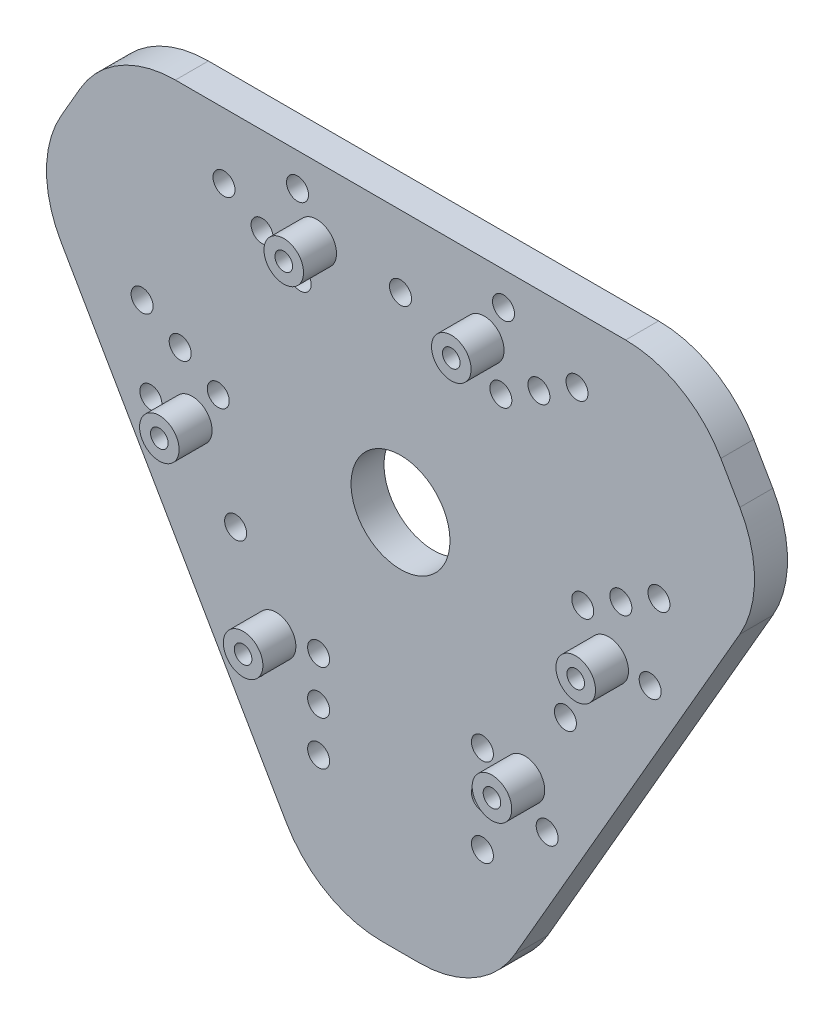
ISO-10303-21;
HEADER;
FILE_DESCRIPTION(('STEP AP214'),'2;1');
FILE_NAME('part.step','',(''),(''),'','','');
FILE_SCHEMA(('AUTOMOTIVE_DESIGN { 1 0 10303 214 1 1 1 1 }'));
ENDSEC;
DATA;
#1=APPLICATION_CONTEXT('core data for automotive mechanical design processes');
#2=APPLICATION_PROTOCOL_DEFINITION('international standard','automotive_design',2000,#1);
#3=PRODUCT_CONTEXT('',#1,'mechanical');
#4=PRODUCT('Part','Part','',(#3));
#5=PRODUCT_RELATED_PRODUCT_CATEGORY('part','',(#4));
#6=PRODUCT_DEFINITION_FORMATION('','',#4);
#7=PRODUCT_DEFINITION_CONTEXT('part definition',#1,'design');
#8=PRODUCT_DEFINITION('design','',#6,#7);
#9=PRODUCT_DEFINITION_SHAPE('','',#8);
#10=(LENGTH_UNIT() NAMED_UNIT(*) SI_UNIT(.MILLI.,.METRE.));
#11=(NAMED_UNIT(*) PLANE_ANGLE_UNIT() SI_UNIT($,.RADIAN.));
#12=(NAMED_UNIT(*) SI_UNIT($,.STERADIAN.) SOLID_ANGLE_UNIT());
#13=UNCERTAINTY_MEASURE_WITH_UNIT(LENGTH_MEASURE(1.E-05),#10,'distance_accuracy_value','');
#14=(GEOMETRIC_REPRESENTATION_CONTEXT(3) GLOBAL_UNCERTAINTY_ASSIGNED_CONTEXT((#13)) GLOBAL_UNIT_ASSIGNED_CONTEXT((#10,
#11,#12)) REPRESENTATION_CONTEXT('',''));
#15=CARTESIAN_POINT('',(0.,0.,0.));
#16=DIRECTION('',(0.,0.,1.));
#17=DIRECTION('',(1.,0.,0.));
#18=AXIS2_PLACEMENT_3D('',#15,#16,#17);
#19=CARTESIAN_POINT('',(0.,0.,3.));
#20=DIRECTION('',(0.,0.,1.));
#21=DIRECTION('',(1.,0.,0.));
#22=AXIS2_PLACEMENT_3D('',#19,#20,#21);
#23=PLANE('',#22);
#24=CARTESIAN_POINT('',(11.3181533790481,3.50765914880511,3.));
#25=DIRECTION('',(0.,0.,1.));
#26=DIRECTION('',(-0.499999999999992,-0.866025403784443,0.));
#27=AXIS2_PLACEMENT_3D('',#24,#25,#26);
#28=CIRCLE('',#27,1.80000000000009);
#29=CARTESIAN_POINT('',(10.4181533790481,1.94881342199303,3.));
#30=VERTEX_POINT('',#29);
#31=EDGE_CURVE('E609',#30,#30,#28,.T.);
#32=ORIENTED_EDGE('',*,*,#31,.F.);
#33=EDGE_LOOP('',(#32));
#34=FACE_BOUND('',#33,.T.);
#35=CARTESIAN_POINT('',(-18.9381533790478,16.7058863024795,3.));
#36=DIRECTION('',(0.,0.,1.));
#37=DIRECTION('',(-0.500000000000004,0.866025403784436,0.));
#38=AXIS2_PLACEMENT_3D('',#35,#36,#37);
#39=CIRCLE('',#38,1.80000000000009);
#40=CARTESIAN_POINT('',(-19.8381533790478,18.2647320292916,3.));
#41=VERTEX_POINT('',#40);
#42=EDGE_CURVE('E585',#41,#41,#39,.T.);
#43=ORIENTED_EDGE('',*,*,#42,.F.);
#44=EDGE_LOOP('',(#43));
#45=FACE_BOUND('',#44,.T.);
#46=CARTESIAN_POINT('',(7.6199999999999,36.309503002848,3.));
#47=DIRECTION('',(0.,0.,1.));
#48=DIRECTION('',(1.,0.,0.));
#49=AXIS2_PLACEMENT_3D('',#46,#47,#48);
#50=CIRCLE('',#49,1.80000000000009);
#51=CARTESIAN_POINT('',(9.41999999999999,36.309503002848,3.));
#52=VERTEX_POINT('',#51);
#53=EDGE_CURVE('E545',#52,#52,#50,.T.);
#54=ORIENTED_EDGE('',*,*,#53,.F.);
#55=EDGE_LOOP('',(#54));
#56=FACE_BOUND('',#55,.T.);
#57=CARTESIAN_POINT('',(-9.36929256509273,39.6567147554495,3.));
#58=DIRECTION('',(0.,0.,1.));
#59=DIRECTION('',(-0.499999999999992,-0.866025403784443,0.));
#60=AXIS2_PLACEMENT_3D('',#57,#58,#59);
#61=CIRCLE('',#60,1.);
#62=CARTESIAN_POINT('',(-9.86929256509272,38.790689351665,3.));
#63=VERTEX_POINT('',#62);
#64=EDGE_CURVE('E497',#63,#63,#61,.T.);
#65=ORIENTED_EDGE('',*,*,#64,.F.);
#66=EDGE_LOOP('',(#65));
#67=FACE_BOUND('',#66,.T.);
#68=CARTESIAN_POINT('',(9.3692925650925,39.6567147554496,3.));
#69=DIRECTION('',(0.,0.,1.));
#70=DIRECTION('',(-0.499999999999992,-0.866025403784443,0.));
#71=AXIS2_PLACEMENT_3D('',#68,#69,#70);
#72=CIRCLE('',#71,1.);
#73=CARTESIAN_POINT('',(8.8692925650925,38.7906893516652,3.));
#74=VERTEX_POINT('',#73);
#75=EDGE_CURVE('E506',#74,#74,#72,.T.);
#76=ORIENTED_EDGE('',*,*,#75,.F.);
#77=EDGE_LOOP('',(#76));
#78=FACE_BOUND('',#77,.T.);
#79=CARTESIAN_POINT('',(0.,36.1615242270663,3.));
#80=DIRECTION('',(0.,0.,1.));
#81=DIRECTION('',(-0.499999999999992,-0.866025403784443,0.));
#82=AXIS2_PLACEMENT_3D('',#79,#80,#81);
#83=CIRCLE('',#82,0.999999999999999);
#84=CARTESIAN_POINT('',(-0.500000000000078,35.2954988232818,3.));
#85=VERTEX_POINT('',#84);
#86=EDGE_CURVE('E514',#85,#85,#83,.T.);
#87=ORIENTED_EDGE('',*,*,#86,.F.);
#88=EDGE_LOOP('',(#87));
#89=FACE_BOUND('',#88,.T.);
#90=CARTESIAN_POINT('',(22.711570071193,16.5472122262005,3.));
#91=DIRECTION('',(0.,0.,1.));
#92=DIRECTION('',(-0.500000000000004,0.866025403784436,0.));
#93=AXIS2_PLACEMENT_3D('',#90,#91,#92);
#94=CIRCLE('',#93,1.);
#95=CARTESIAN_POINT('',(22.211570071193,17.4132376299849,3.));
#96=VERTEX_POINT('',#95);
#97=EDGE_CURVE('E522',#96,#96,#94,.T.);
#98=ORIENTED_EDGE('',*,*,#97,.F.);
#99=EDGE_LOOP('',(#98));
#100=FACE_BOUND('',#99,.T.);
#101=CARTESIAN_POINT('',(13.3422775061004,0.319121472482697,3.));
#102=DIRECTION('',(0.,0.,1.));
#103=DIRECTION('',(-0.500000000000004,0.866025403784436,0.));
#104=AXIS2_PLACEMENT_3D('',#101,#102,#103);
#105=CIRCLE('',#104,1.);
#106=CARTESIAN_POINT('',(12.8422775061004,1.18514687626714,3.));
#107=VERTEX_POINT('',#106);
#108=EDGE_CURVE('E530',#107,#107,#105,.T.);
#109=ORIENTED_EDGE('',*,*,#108,.F.);
#110=EDGE_LOOP('',(#109));
#111=FACE_BOUND('',#110,.T.);
#112=CARTESIAN_POINT('',(15.,10.1807621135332,3.));
#113=DIRECTION('',(0.,0.,1.));
#114=DIRECTION('',(-0.500000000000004,0.866025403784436,0.));
#115=AXIS2_PLACEMENT_3D('',#112,#113,#114);
#116=CIRCLE('',#115,0.999999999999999);
#117=CARTESIAN_POINT('',(14.5,11.0467875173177,3.));
#118=VERTEX_POINT('',#117);
#119=EDGE_CURVE('E489',#118,#118,#116,.T.);
#120=ORIENTED_EDGE('',*,*,#119,.F.);
#121=EDGE_LOOP('',(#120));
#122=FACE_BOUND('',#121,.T.);
#123=CARTESIAN_POINT('',(-7.45000000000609,-4.00000000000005,3.));
#124=DIRECTION('',(0.,0.,1.));
#125=DIRECTION('',(-0.500000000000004,0.866025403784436,0.));
#126=AXIS2_PLACEMENT_3D('',#123,#124,#125);
#127=CIRCLE('',#126,1.);
#128=CARTESIAN_POINT('',(-7.9500000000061,-3.13397459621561,3.));
#129=VERTEX_POINT('',#128);
#130=EDGE_CURVE('E442',#129,#129,#127,.T.);
#131=ORIENTED_EDGE('',*,*,#130,.F.);
#132=EDGE_LOOP('',(#131));
#133=FACE_BOUND('',#132,.T.);
#134=CARTESIAN_POINT('',(16.5776970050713,19.809634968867,3.));
#135=DIRECTION('',(0.,0.,1.));
#136=DIRECTION('',(-0.499999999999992,-0.866025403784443,0.));
#137=AXIS2_PLACEMENT_3D('',#134,#135,#136);
#138=CIRCLE('',#137,1.00000000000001);
#139=CARTESIAN_POINT('',(16.0776970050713,18.9436095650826,3.));
#140=VERTEX_POINT('',#139);
#141=EDGE_CURVE('E433',#140,#140,#138,.T.);
#142=ORIENTED_EDGE('',*,*,#141,.F.);
#143=EDGE_LOOP('',(#142));
#144=FACE_BOUND('',#143,.T.);
#145=CARTESIAN_POINT('',(20.041798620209,21.809634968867,3.));
#146=DIRECTION('',(0.,0.,1.));
#147=DIRECTION('',(-0.499999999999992,-0.866025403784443,0.));
#148=AXIS2_PLACEMENT_3D('',#145,#146,#147);
#149=CIRCLE('',#148,0.999999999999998);
#150=CARTESIAN_POINT('',(19.541798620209,20.9436095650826,3.));
#151=VERTEX_POINT('',#150);
#152=EDGE_CURVE('E458',#151,#151,#149,.T.);
#153=ORIENTED_EDGE('',*,*,#152,.F.);
#154=EDGE_LOOP('',(#153));
#155=FACE_BOUND('',#154,.T.);
#156=CARTESIAN_POINT('',(9.12769700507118,32.7134134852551,3.));
#157=DIRECTION('',(0.,0.,1.));
#158=DIRECTION('',(-0.499999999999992,-0.866025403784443,0.));
#159=AXIS2_PLACEMENT_3D('',#156,#157,#158);
#160=CIRCLE('',#159,1.);
#161=CARTESIAN_POINT('',(8.62769700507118,31.8473880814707,3.));
#162=VERTEX_POINT('',#161);
#163=EDGE_CURVE('E449',#162,#162,#160,.T.);
#164=ORIENTED_EDGE('',*,*,#163,.F.);
#165=EDGE_LOOP('',(#164));
#166=FACE_BOUND('',#165,.T.);
#167=CARTESIAN_POINT('',(-7.4500000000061,0.,3.));
#168=DIRECTION('',(0.,0.,1.));
#169=DIRECTION('',(-0.500000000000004,0.866025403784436,0.));
#170=AXIS2_PLACEMENT_3D('',#167,#168,#169);
#171=CIRCLE('',#170,0.999999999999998);
#172=CARTESIAN_POINT('',(-7.95000000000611,0.86602540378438,3.));
#173=VERTEX_POINT('',#172);
#174=EDGE_CURVE('E410',#173,#173,#171,.T.);
#175=ORIENTED_EDGE('',*,*,#174,.F.);
#176=EDGE_LOOP('',(#175));
#177=FACE_BOUND('',#176,.T.);
#178=CARTESIAN_POINT('',(7.44999999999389,3.99999999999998,3.));
#179=DIRECTION('',(0.,0.,1.));
#180=DIRECTION('',(-0.500000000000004,0.866025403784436,0.));
#181=AXIS2_PLACEMENT_3D('',#178,#179,#180);
#182=CIRCLE('',#181,1.);
#183=CARTESIAN_POINT('',(6.94999999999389,4.86602540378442,3.));
#184=VERTEX_POINT('',#183);
#185=EDGE_CURVE('E401',#184,#184,#182,.T.);
#186=ORIENTED_EDGE('',*,*,#185,.F.);
#187=EDGE_LOOP('',(#186));
#188=FACE_BOUND('',#187,.T.);
#189=CARTESIAN_POINT('',(7.4499999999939,0.,3.));
#190=DIRECTION('',(0.,0.,1.));
#191=DIRECTION('',(-0.500000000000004,0.866025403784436,0.));
#192=AXIS2_PLACEMENT_3D('',#189,#190,#191);
#193=CIRCLE('',#192,1.);
#194=CARTESIAN_POINT('',(6.9499999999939,0.866025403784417,3.));
#195=VERTEX_POINT('',#194);
#196=EDGE_CURVE('E426',#195,#195,#193,.T.);
#197=ORIENTED_EDGE('',*,*,#196,.F.);
#198=EDGE_LOOP('',(#197));
#199=FACE_BOUND('',#198,.T.);
#200=CARTESIAN_POINT('',(7.44999999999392,-4.00000000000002,3.));
#201=DIRECTION('',(0.,0.,1.));
#202=DIRECTION('',(-0.500000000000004,0.866025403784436,0.));
#203=AXIS2_PLACEMENT_3D('',#200,#201,#202);
#204=CIRCLE('',#203,0.999999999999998);
#205=CARTESIAN_POINT('',(6.94999999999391,-3.13397459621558,3.));
#206=VERTEX_POINT('',#205);
#207=EDGE_CURVE('E417',#206,#206,#204,.T.);
#208=ORIENTED_EDGE('',*,*,#207,.F.);
#209=EDGE_LOOP('',(#208));
#210=FACE_BOUND('',#209,.T.);
#211=CARTESIAN_POINT('',(12.5917986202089,34.7134134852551,3.));
#212=DIRECTION('',(0.,0.,1.));
#213=DIRECTION('',(-0.499999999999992,-0.866025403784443,0.));
#214=AXIS2_PLACEMENT_3D('',#211,#212,#213);
#215=CIRCLE('',#214,1.);
#216=CARTESIAN_POINT('',(12.0917986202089,33.8473880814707,3.));
#217=VERTEX_POINT('',#216);
#218=EDGE_CURVE('E482',#217,#217,#215,.T.);
#219=ORIENTED_EDGE('',*,*,#218,.F.);
#220=EDGE_LOOP('',(#219));
#221=FACE_BOUND('',#220,.T.);
#222=CARTESIAN_POINT('',(16.0559002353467,36.7134134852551,3.));
#223=DIRECTION('',(0.,0.,1.));
#224=DIRECTION('',(-0.499999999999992,-0.866025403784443,0.));
#225=AXIS2_PLACEMENT_3D('',#222,#223,#224);
#226=CIRCLE('',#225,0.999999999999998);
#227=CARTESIAN_POINT('',(15.5559002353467,35.8473880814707,3.));
#228=VERTEX_POINT('',#227);
#229=EDGE_CURVE('E474',#228,#228,#226,.T.);
#230=ORIENTED_EDGE('',*,*,#229,.F.);
#231=EDGE_LOOP('',(#230));
#232=FACE_BOUND('',#231,.T.);
#233=CARTESIAN_POINT('',(23.5059002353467,23.8096349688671,3.));
#234=DIRECTION('',(0.,0.,1.));
#235=DIRECTION('',(-0.499999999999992,-0.866025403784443,0.));
#236=AXIS2_PLACEMENT_3D('',#233,#234,#235);
#237=CIRCLE('',#236,1.);
#238=CARTESIAN_POINT('',(23.0059002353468,22.9436095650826,3.));
#239=VERTEX_POINT('',#238);
#240=EDGE_CURVE('E465',#239,#239,#237,.T.);
#241=ORIENTED_EDGE('',*,*,#240,.F.);
#242=EDGE_LOOP('',(#241));
#243=FACE_BOUND('',#242,.T.);
#244=CARTESIAN_POINT('',(-7.45000000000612,3.99999999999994,3.));
#245=DIRECTION('',(0.,0.,1.));
#246=DIRECTION('',(-0.500000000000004,0.866025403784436,0.));
#247=AXIS2_PLACEMENT_3D('',#244,#245,#246);
#248=CIRCLE('',#247,1.00000000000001);
#249=CARTESIAN_POINT('',(-7.95000000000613,4.86602540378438,3.));
#250=VERTEX_POINT('',#249);
#251=EDGE_CURVE('E393',#250,#250,#248,.T.);
#252=ORIENTED_EDGE('',*,*,#251,.F.);
#253=EDGE_LOOP('',(#252));
#254=FACE_BOUND('',#253,.T.);
#255=CARTESIAN_POINT('',(-13.3422775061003,0.319121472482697,3.));
#256=DIRECTION('',(0.,0.,1.));
#257=DIRECTION('',(1.,0.,0.));
#258=AXIS2_PLACEMENT_3D('',#255,#256,#257);
#259=CIRCLE('',#258,1.);
#260=CARTESIAN_POINT('',(-12.3422775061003,0.319121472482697,3.));
#261=VERTEX_POINT('',#260);
#262=EDGE_CURVE('E377',#261,#261,#259,.T.);
#263=ORIENTED_EDGE('',*,*,#262,.F.);
#264=EDGE_LOOP('',(#263));
#265=FACE_BOUND('',#264,.T.);
#266=CARTESIAN_POINT('',(-22.7115700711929,16.5472122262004,3.));
#267=DIRECTION('',(0.,0.,1.));
#268=DIRECTION('',(1.,0.,0.));
#269=AXIS2_PLACEMENT_3D('',#266,#267,#268);
#270=CIRCLE('',#269,1.);
#271=CARTESIAN_POINT('',(-21.7115700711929,16.5472122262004,3.));
#272=VERTEX_POINT('',#271);
#273=EDGE_CURVE('E386',#272,#272,#270,.T.);
#274=ORIENTED_EDGE('',*,*,#273,.F.);
#275=EDGE_LOOP('',(#274));
#276=FACE_BOUND('',#275,.T.);
#277=CARTESIAN_POINT('',(-14.9999999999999,10.1807621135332,3.));
#278=DIRECTION('',(0.,0.,1.));
#279=DIRECTION('',(1.,0.,0.));
#280=AXIS2_PLACEMENT_3D('',#277,#278,#279);
#281=CIRCLE('',#280,0.999999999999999);
#282=CARTESIAN_POINT('',(-13.9999999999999,10.1807621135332,3.));
#283=VERTEX_POINT('',#282);
#284=EDGE_CURVE('E369',#283,#283,#281,.T.);
#285=ORIENTED_EDGE('',*,*,#284,.F.);
#286=EDGE_LOOP('',(#285));
#287=FACE_BOUND('',#286,.T.);
#288=CARTESIAN_POINT('',(0.,18.8410161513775,3.));
#289=DIRECTION('',(0.,0.,1.));
#290=DIRECTION('',(1.,0.,0.));
#291=AXIS2_PLACEMENT_3D('',#288,#289,#290);
#292=CIRCLE('',#291,4.5);
#293=CARTESIAN_POINT('',(4.50000000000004,18.8410161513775,3.));
#294=VERTEX_POINT('',#293);
#295=EDGE_CURVE('E361',#294,#294,#292,.T.);
#296=ORIENTED_EDGE('',*,*,#295,.F.);
#297=EDGE_LOOP('',(#296));
#298=FACE_BOUND('',#297,.T.);
#299=CARTESIAN_POINT('',(-9.12769700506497,32.7134134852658,3.));
#300=DIRECTION('',(0.,0.,1.));
#301=DIRECTION('',(1.,0.,0.));
#302=AXIS2_PLACEMENT_3D('',#299,#300,#301);
#303=CIRCLE('',#302,1.00000000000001);
#304=CARTESIAN_POINT('',(-8.12769700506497,32.7134134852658,3.));
#305=VERTEX_POINT('',#304);
#306=EDGE_CURVE('E346',#305,#305,#303,.T.);
#307=ORIENTED_EDGE('',*,*,#306,.F.);
#308=EDGE_LOOP('',(#307));
#309=FACE_BOUND('',#308,.T.);
#310=CARTESIAN_POINT('',(-16.0559002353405,36.7134134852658,3.));
#311=DIRECTION('',(0.,0.,1.));
#312=DIRECTION('',(1.,0.,0.));
#313=AXIS2_PLACEMENT_3D('',#310,#311,#312);
#314=CIRCLE('',#313,1.);
#315=CARTESIAN_POINT('',(-15.0559002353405,36.7134134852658,3.));
#316=VERTEX_POINT('',#315);
#317=EDGE_CURVE('E347',#316,#316,#314,.T.);
#318=ORIENTED_EDGE('',*,*,#317,.F.);
#319=EDGE_LOOP('',(#318));
#320=FACE_BOUND('',#319,.T.);
#321=CARTESIAN_POINT('',(-23.5059002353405,23.8096349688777,3.));
#322=DIRECTION('',(0.,0.,1.));
#323=DIRECTION('',(1.,0.,0.));
#324=AXIS2_PLACEMENT_3D('',#321,#322,#323);
#325=CIRCLE('',#324,0.999999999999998);
#326=CARTESIAN_POINT('',(-22.5059002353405,23.8096349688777,3.));
#327=VERTEX_POINT('',#326);
#328=EDGE_CURVE('E313',#327,#327,#325,.T.);
#329=ORIENTED_EDGE('',*,*,#328,.F.);
#330=EDGE_LOOP('',(#329));
#331=FACE_BOUND('',#330,.T.);
#332=CARTESIAN_POINT('',(-20.0417986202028,21.8096349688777,3.));
#333=DIRECTION('',(0.,0.,1.));
#334=DIRECTION('',(1.,0.,0.));
#335=AXIS2_PLACEMENT_3D('',#332,#333,#334);
#336=CIRCLE('',#335,1.);
#337=CARTESIAN_POINT('',(-19.0417986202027,21.8096349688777,3.));
#338=VERTEX_POINT('',#337);
#339=EDGE_CURVE('E322',#338,#338,#336,.T.);
#340=ORIENTED_EDGE('',*,*,#339,.F.);
#341=EDGE_LOOP('',(#340));
#342=FACE_BOUND('',#341,.T.);
#343=CARTESIAN_POINT('',(-16.577697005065,19.8096349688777,3.));
#344=DIRECTION('',(0.,0.,1.));
#345=DIRECTION('',(1.,0.,0.));
#346=AXIS2_PLACEMENT_3D('',#343,#344,#345);
#347=CIRCLE('',#346,1.);
#348=CARTESIAN_POINT('',(-15.577697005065,19.8096349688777,3.));
#349=VERTEX_POINT('',#348);
#350=EDGE_CURVE('E330',#349,#349,#347,.T.);
#351=ORIENTED_EDGE('',*,*,#350,.F.);
#352=EDGE_LOOP('',(#351));
#353=FACE_BOUND('',#352,.T.);
#354=CARTESIAN_POINT('',(-12.5917986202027,34.7134134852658,3.));
#355=DIRECTION('',(0.,0.,1.));
#356=DIRECTION('',(1.,0.,0.));
#357=AXIS2_PLACEMENT_3D('',#354,#355,#356);
#358=CIRCLE('',#357,0.999999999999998);
#359=CARTESIAN_POINT('',(-11.5917986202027,34.7134134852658,3.));
#360=VERTEX_POINT('',#359);
#361=EDGE_CURVE('E338',#360,#360,#358,.T.);
#362=ORIENTED_EDGE('',*,*,#361,.F.);
#363=EDGE_LOOP('',(#362));
#364=FACE_BOUND('',#363,.T.);
#365=DIRECTION('',(-0.5,0.866025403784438,0.));
#366=VECTOR('',#365,1.);
#367=CARTESIAN_POINT('',(33.75,29.6663336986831,3.));
#368=LINE('',#367,#366);
#369=CARTESIAN_POINT('',(30.8632486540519,34.6663336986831,3.));
#370=VERTEX_POINT('',#369);
#371=CARTESIAN_POINT('',(29.1367513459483,37.6567147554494,3.));
#372=VERTEX_POINT('',#371);
#373=EDGE_CURVE('E306',#370,#372,#368,.T.);
#374=ORIENTED_EDGE('',*,*,#373,.T.);
#375=CARTESIAN_POINT('',(20.4764973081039,32.6567147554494,3.));
#376=DIRECTION('',(0.,0.,1.));
#377=DIRECTION('',(1.,0.,0.));
#378=AXIS2_PLACEMENT_3D('',#375,#376,#377);
#379=CIRCLE('',#378,10.);
#380=CARTESIAN_POINT('',(20.4764973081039,42.6567147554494,3.));
#381=VERTEX_POINT('',#380);
#382=EDGE_CURVE('E243',#372,#381,#379,.T.);
#383=ORIENTED_EDGE('',*,*,#382,.T.);
#384=DIRECTION('',(-1.,0.,0.));
#385=VECTOR('',#384,1.);
#386=CARTESIAN_POINT('',(26.2500000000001,42.6567147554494,3.));
#387=LINE('',#386,#385);
#388=CARTESIAN_POINT('',(-20.4764973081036,42.6567147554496,3.));
#389=VERTEX_POINT('',#388);
#390=EDGE_CURVE('E189',#381,#389,#387,.T.);
#391=ORIENTED_EDGE('',*,*,#390,.T.);
#392=CARTESIAN_POINT('',(-20.4764973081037,32.6567147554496,3.));
#393=DIRECTION('',(0.,0.,1.));
#394=DIRECTION('',(1.,0.,0.));
#395=AXIS2_PLACEMENT_3D('',#392,#393,#394);
#396=CIRCLE('',#395,10.);
#397=CARTESIAN_POINT('',(-29.1367513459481,37.6567147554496,3.));
#398=VERTEX_POINT('',#397);
#399=EDGE_CURVE('E100',#389,#398,#396,.T.);
#400=ORIENTED_EDGE('',*,*,#399,.T.);
#401=DIRECTION('',(-0.5,-0.866025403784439,0.));
#402=VECTOR('',#401,1.);
#403=CARTESIAN_POINT('',(-26.2499999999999,42.6567147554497,3.));
#404=LINE('',#403,#402);
#405=CARTESIAN_POINT('',(-30.8632486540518,34.6663336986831,3.));
#406=VERTEX_POINT('',#405);
#407=EDGE_CURVE('E210',#398,#406,#404,.T.);
#408=ORIENTED_EDGE('',*,*,#407,.T.);
#409=CARTESIAN_POINT('',(-22.2029946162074,29.6663336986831,3.));
#410=DIRECTION('',(0.,0.,1.));
#411=DIRECTION('',(1.,0.,0.));
#412=AXIS2_PLACEMENT_3D('',#409,#410,#411);
#413=CIRCLE('',#412,10.);
#414=CARTESIAN_POINT('',(-30.8632486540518,24.6663336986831,3.));
#415=VERTEX_POINT('',#414);
#416=EDGE_CURVE('E235',#406,#415,#413,.T.);
#417=ORIENTED_EDGE('',*,*,#416,.T.);
#418=DIRECTION('',(0.5,-0.866025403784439,0.));
#419=VECTOR('',#418,1.);
#420=CARTESIAN_POINT('',(-33.7499999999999,29.6663336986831,3.));
#421=LINE('',#420,#419);
#422=CARTESIAN_POINT('',(-10.386751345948,-10.8,3.));
#423=VERTEX_POINT('',#422);
#424=EDGE_CURVE('E203',#415,#423,#421,.T.);
#425=ORIENTED_EDGE('',*,*,#424,.T.);
#426=CARTESIAN_POINT('',(-1.72649730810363,-5.80000000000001,3.));
#427=DIRECTION('',(0.,0.,1.));
#428=DIRECTION('',(1.,0.,0.));
#429=AXIS2_PLACEMENT_3D('',#426,#427,#428);
#430=CIRCLE('',#429,10.);
#431=CARTESIAN_POINT('',(-1.72649730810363,-15.8,3.));
#432=VERTEX_POINT('',#431);
#433=EDGE_CURVE('E232',#423,#432,#430,.T.);
#434=ORIENTED_EDGE('',*,*,#433,.T.);
#435=DIRECTION('',(1.,0.,0.));
#436=VECTOR('',#435,1.);
#437=CARTESIAN_POINT('',(-7.49999999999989,-15.8,3.));
#438=LINE('',#437,#436);
#439=CARTESIAN_POINT('',(1.72649730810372,-15.8,3.));
#440=VERTEX_POINT('',#439);
#441=EDGE_CURVE('E272',#432,#440,#438,.T.);
#442=ORIENTED_EDGE('',*,*,#441,.T.);
#443=CARTESIAN_POINT('',(1.72649730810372,-5.80000000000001,3.));
#444=DIRECTION('',(0.,0.,1.));
#445=DIRECTION('',(1.,0.,0.));
#446=AXIS2_PLACEMENT_3D('',#443,#444,#445);
#447=CIRCLE('',#446,10.);
#448=CARTESIAN_POINT('',(10.3867513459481,-10.8,3.));
#449=VERTEX_POINT('',#448);
#450=EDGE_CURVE('E229',#440,#449,#447,.T.);
#451=ORIENTED_EDGE('',*,*,#450,.T.);
#452=DIRECTION('',(0.5,0.866025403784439,0.));
#453=VECTOR('',#452,1.);
#454=CARTESIAN_POINT('',(7.49999999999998,-15.8,3.));
#455=LINE('',#454,#453);
#456=CARTESIAN_POINT('',(30.8632486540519,24.6663336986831,3.));
#457=VERTEX_POINT('',#456);
#458=EDGE_CURVE('E285',#449,#457,#455,.T.);
#459=ORIENTED_EDGE('',*,*,#458,.T.);
#460=CARTESIAN_POINT('',(22.2029946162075,29.6663336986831,3.));
#461=DIRECTION('',(0.,0.,1.));
#462=DIRECTION('',(1.,0.,0.));
#463=AXIS2_PLACEMENT_3D('',#460,#461,#462);
#464=CIRCLE('',#463,10.);
#465=EDGE_CURVE('E240',#457,#370,#464,.T.);
#466=ORIENTED_EDGE('',*,*,#465,.T.);
#467=EDGE_LOOP('',(#374,#383,#391,#400,#408,#417,#425,#434,#442,#451,#459,#466));
#468=FACE_BOUND('',#467,.T.);
#469=CARTESIAN_POINT('',(-7.6200000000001,36.309503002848,3.));
#470=DIRECTION('',(0.,0.,1.));
#471=DIRECTION('',(1.,0.,0.));
#472=AXIS2_PLACEMENT_3D('',#469,#470,#471);
#473=CIRCLE('',#472,1.80000000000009);
#474=CARTESIAN_POINT('',(-5.82000000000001,36.309503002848,3.));
#475=VERTEX_POINT('',#474);
#476=EDGE_CURVE('E557',#475,#475,#473,.T.);
#477=ORIENTED_EDGE('',*,*,#476,.F.);
#478=EDGE_LOOP('',(#477));
#479=FACE_BOUND('',#478,.T.);
#480=CARTESIAN_POINT('',(-11.3181533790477,3.5076591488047,3.));
#481=DIRECTION('',(0.,0.,1.));
#482=DIRECTION('',(-0.500000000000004,0.866025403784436,0.));
#483=AXIS2_PLACEMENT_3D('',#480,#481,#482);
#484=CIRCLE('',#483,1.80000000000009);
#485=CARTESIAN_POINT('',(-12.2181533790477,5.06650487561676,3.));
#486=VERTEX_POINT('',#485);
#487=EDGE_CURVE('E597',#486,#486,#484,.T.);
#488=ORIENTED_EDGE('',*,*,#487,.F.);
#489=EDGE_LOOP('',(#488));
#490=FACE_BOUND('',#489,.T.);
#491=CARTESIAN_POINT('',(18.938153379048,16.70588630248,3.));
#492=DIRECTION('',(0.,0.,1.));
#493=DIRECTION('',(-0.499999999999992,-0.866025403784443,0.));
#494=AXIS2_PLACEMENT_3D('',#491,#492,#493);
#495=CIRCLE('',#494,1.80000000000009);
#496=CARTESIAN_POINT('',(18.038153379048,15.147040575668,3.));
#497=VERTEX_POINT('',#496);
#498=EDGE_CURVE('E621',#497,#497,#495,.T.);
#499=ORIENTED_EDGE('',*,*,#498,.F.);
#500=EDGE_LOOP('',(#499));
#501=FACE_BOUND('',#500,.T.);
#502=ADVANCED_FACE('F77',(#34,#45,#56,#67,#78,#89,#100,#111,#122,#133,#144,#155,#166,#177,#188,
#199,#210,#221,#232,#243,#254,#265,#276,#287,#298,#309,#320,#331,#342,#353,#364,#468,#479,#490,
#501),#23,.T.);
#503=CARTESIAN_POINT('',(-33.7499999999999,29.6663336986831,3.));
#504=DIRECTION('',(0.866025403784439,0.5,0.));
#505=DIRECTION('',(-0.5,0.866025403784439,0.));
#506=AXIS2_PLACEMENT_3D('',#503,#504,#505);
#507=PLANE('',#506);
#508=ORIENTED_EDGE('',*,*,#424,.F.);
#509=DIRECTION('',(0.,0.,-1.));
#510=VECTOR('',#509,1.);
#511=CARTESIAN_POINT('',(-30.8632486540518,24.6663336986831,3.));
#512=LINE('',#511,#510);
#513=CARTESIAN_POINT('',(-30.8632486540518,24.6663336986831,0.));
#514=VERTEX_POINT('',#513);
#515=EDGE_CURVE('E262',#415,#514,#512,.T.);
#516=ORIENTED_EDGE('',*,*,#515,.T.);
#517=DIRECTION('',(0.5,-0.866025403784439,0.));
#518=VECTOR('',#517,1.);
#519=CARTESIAN_POINT('',(-33.7499999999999,29.6663336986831,0.));
#520=LINE('',#519,#518);
#521=CARTESIAN_POINT('',(-10.386751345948,-10.8,0.));
#522=VERTEX_POINT('',#521);
#523=EDGE_CURVE('E295',#514,#522,#520,.T.);
#524=ORIENTED_EDGE('',*,*,#523,.T.);
#525=DIRECTION('',(0.,0.,-1.));
#526=VECTOR('',#525,1.);
#527=CARTESIAN_POINT('',(-10.386751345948,-10.8,3.));
#528=LINE('',#527,#526);
#529=EDGE_CURVE('E259',#522,#423,#528,.F.);
#530=ORIENTED_EDGE('',*,*,#529,.T.);
#531=EDGE_LOOP('',(#508,#516,#524,#530));
#532=FACE_BOUND('',#531,.T.);
#533=ADVANCED_FACE('F651',(#532),#507,.F.);
#534=CARTESIAN_POINT('',(-7.49999999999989,-15.8,3.));
#535=DIRECTION('',(0.,1.,0.));
#536=DIRECTION('',(0.,0.,1.));
#537=AXIS2_PLACEMENT_3D('',#534,#535,#536);
#538=PLANE('',#537);
#539=ORIENTED_EDGE('',*,*,#441,.F.);
#540=DIRECTION('',(0.,0.,-1.));
#541=VECTOR('',#540,1.);
#542=CARTESIAN_POINT('',(-1.72649730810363,-15.8,3.));
#543=LINE('',#542,#541);
#544=CARTESIAN_POINT('',(-1.72649730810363,-15.8,0.));
#545=VERTEX_POINT('',#544);
#546=EDGE_CURVE('E12',#432,#545,#543,.T.);
#547=ORIENTED_EDGE('',*,*,#546,.T.);
#548=DIRECTION('',(1.,0.,0.));
#549=VECTOR('',#548,1.);
#550=CARTESIAN_POINT('',(-7.49999999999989,-15.8,0.));
#551=LINE('',#550,#549);
#552=CARTESIAN_POINT('',(1.72649730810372,-15.8,0.));
#553=VERTEX_POINT('',#552);
#554=EDGE_CURVE('E275',#545,#553,#551,.T.);
#555=ORIENTED_EDGE('',*,*,#554,.T.);
#556=DIRECTION('',(0.,0.,-1.));
#557=VECTOR('',#556,1.);
#558=CARTESIAN_POINT('',(1.72649730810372,-15.8,3.));
#559=LINE('',#558,#557);
#560=EDGE_CURVE('E86',#553,#440,#559,.F.);
#561=ORIENTED_EDGE('',*,*,#560,.T.);
#562=EDGE_LOOP('',(#539,#547,#555,#561));
#563=FACE_BOUND('',#562,.T.);
#564=ADVANCED_FACE('F271',(#563),#538,.F.);
#565=CARTESIAN_POINT('',(7.49999999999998,-15.8,3.));
#566=DIRECTION('',(-0.866025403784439,0.5,0.));
#567=DIRECTION('',(-0.5,-0.866025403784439,0.));
#568=AXIS2_PLACEMENT_3D('',#565,#566,#567);
#569=PLANE('',#568);
#570=DIRECTION('',(0.5,0.866025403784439,0.));
#571=VECTOR('',#570,1.);
#572=CARTESIAN_POINT('',(7.49999999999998,-15.8,0.));
#573=LINE('',#572,#571);
#574=CARTESIAN_POINT('',(10.3867513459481,-10.8,0.));
#575=VERTEX_POINT('',#574);
#576=CARTESIAN_POINT('',(30.8632486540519,24.6663336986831,0.));
#577=VERTEX_POINT('',#576);
#578=EDGE_CURVE('E205',#575,#577,#573,.T.);
#579=ORIENTED_EDGE('',*,*,#578,.T.);
#580=DIRECTION('',(0.,0.,-1.));
#581=VECTOR('',#580,1.);
#582=CARTESIAN_POINT('',(30.8632486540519,24.6663336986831,3.));
#583=LINE('',#582,#581);
#584=EDGE_CURVE('E250',#577,#457,#583,.F.);
#585=ORIENTED_EDGE('',*,*,#584,.T.);
#586=ORIENTED_EDGE('',*,*,#458,.F.);
#587=DIRECTION('',(0.,0.,-1.));
#588=VECTOR('',#587,1.);
#589=CARTESIAN_POINT('',(10.3867513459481,-10.8,3.));
#590=LINE('',#589,#588);
#591=EDGE_CURVE('E246',#449,#575,#590,.T.);
#592=ORIENTED_EDGE('',*,*,#591,.T.);
#593=EDGE_LOOP('',(#579,#585,#586,#592));
#594=FACE_BOUND('',#593,.T.);
#595=ADVANCED_FACE('F291',(#594),#569,.F.);
#596=CARTESIAN_POINT('',(33.75,29.6663336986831,3.));
#597=DIRECTION('',(-0.866025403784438,-0.5,0.));
#598=DIRECTION('',(0.5,-0.866025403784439,0.));
#599=AXIS2_PLACEMENT_3D('',#596,#597,#598);
#600=PLANE('',#599);
#601=DIRECTION('',(-0.5,0.866025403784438,0.));
#602=VECTOR('',#601,1.);
#603=CARTESIAN_POINT('',(33.75,29.6663336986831,0.));
#604=LINE('',#603,#602);
#605=CARTESIAN_POINT('',(30.8632486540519,34.6663336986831,0.));
#606=VERTEX_POINT('',#605);
#607=CARTESIAN_POINT('',(29.1367513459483,37.6567147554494,0.));
#608=VERTEX_POINT('',#607);
#609=EDGE_CURVE('E199',#606,#608,#604,.T.);
#610=ORIENTED_EDGE('',*,*,#609,.T.);
#611=DIRECTION('',(0.,0.,-1.));
#612=VECTOR('',#611,1.);
#613=CARTESIAN_POINT('',(29.1367513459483,37.6567147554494,3.));
#614=LINE('',#613,#612);
#615=EDGE_CURVE('E174',#608,#372,#614,.F.);
#616=ORIENTED_EDGE('',*,*,#615,.T.);
#617=ORIENTED_EDGE('',*,*,#373,.F.);
#618=DIRECTION('',(0.,0.,-1.));
#619=VECTOR('',#618,1.);
#620=CARTESIAN_POINT('',(30.8632486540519,34.6663336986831,3.));
#621=LINE('',#620,#619);
#622=EDGE_CURVE('E180',#370,#606,#621,.T.);
#623=ORIENTED_EDGE('',*,*,#622,.T.);
#624=EDGE_LOOP('',(#610,#616,#617,#623));
#625=FACE_BOUND('',#624,.T.);
#626=ADVANCED_FACE('F674',(#625),#600,.F.);
#627=CARTESIAN_POINT('',(26.2500000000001,42.6567147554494,3.));
#628=DIRECTION('',(0.,-1.,0.));
#629=DIRECTION('',(1.,0.,0.));
#630=AXIS2_PLACEMENT_3D('',#627,#628,#629);
#631=PLANE('',#630);
#632=ORIENTED_EDGE('',*,*,#390,.F.);
#633=DIRECTION('',(0.,0.,-1.));
#634=VECTOR('',#633,1.);
#635=CARTESIAN_POINT('',(20.4764973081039,42.6567147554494,3.));
#636=LINE('',#635,#634);
#637=CARTESIAN_POINT('',(20.4764973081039,42.6567147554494,0.));
#638=VERTEX_POINT('',#637);
#639=EDGE_CURVE('E173',#381,#638,#636,.T.);
#640=ORIENTED_EDGE('',*,*,#639,.T.);
#641=DIRECTION('',(-1.,0.,0.));
#642=VECTOR('',#641,1.);
#643=CARTESIAN_POINT('',(26.2500000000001,42.6567147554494,0.));
#644=LINE('',#643,#642);
#645=CARTESIAN_POINT('',(-20.4764973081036,42.6567147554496,0.));
#646=VERTEX_POINT('',#645);
#647=EDGE_CURVE('E187',#638,#646,#644,.T.);
#648=ORIENTED_EDGE('',*,*,#647,.T.);
#649=DIRECTION('',(0.,0.,-1.));
#650=VECTOR('',#649,1.);
#651=CARTESIAN_POINT('',(-20.4764973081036,42.6567147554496,3.));
#652=LINE('',#651,#650);
#653=EDGE_CURVE('E192',#646,#389,#652,.F.);
#654=ORIENTED_EDGE('',*,*,#653,.T.);
#655=EDGE_LOOP('',(#632,#640,#648,#654));
#656=FACE_BOUND('',#655,.T.);
#657=ADVANCED_FACE('F186',(#656),#631,.F.);
#658=CARTESIAN_POINT('',(-26.2499999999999,42.6567147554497,3.));
#659=DIRECTION('',(0.866025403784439,-0.5,0.));
#660=DIRECTION('',(0.5,0.866025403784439,0.));
#661=AXIS2_PLACEMENT_3D('',#658,#659,#660);
#662=PLANE('',#661);
#663=ORIENTED_EDGE('',*,*,#407,.F.);
#664=DIRECTION('',(0.,0.,-1.));
#665=VECTOR('',#664,1.);
#666=CARTESIAN_POINT('',(-29.1367513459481,37.6567147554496,3.));
#667=LINE('',#666,#665);
#668=CARTESIAN_POINT('',(-29.1367513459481,37.6567147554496,0.));
#669=VERTEX_POINT('',#668);
#670=EDGE_CURVE('E255',#398,#669,#667,.T.);
#671=ORIENTED_EDGE('',*,*,#670,.T.);
#672=DIRECTION('',(-0.5,-0.866025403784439,0.));
#673=VECTOR('',#672,1.);
#674=CARTESIAN_POINT('',(-26.2499999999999,42.6567147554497,0.));
#675=LINE('',#674,#673);
#676=CARTESIAN_POINT('',(-30.8632486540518,34.6663336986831,0.));
#677=VERTEX_POINT('',#676);
#678=EDGE_CURVE('E198',#669,#677,#675,.T.);
#679=ORIENTED_EDGE('',*,*,#678,.T.);
#680=DIRECTION('',(0.,0.,-1.));
#681=VECTOR('',#680,1.);
#682=CARTESIAN_POINT('',(-30.8632486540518,34.6663336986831,3.));
#683=LINE('',#682,#681);
#684=EDGE_CURVE('E93',#677,#406,#683,.F.);
#685=ORIENTED_EDGE('',*,*,#684,.T.);
#686=EDGE_LOOP('',(#663,#671,#679,#685));
#687=FACE_BOUND('',#686,.T.);
#688=ADVANCED_FACE('F668',(#687),#662,.F.);
#689=CARTESIAN_POINT('',(0.,0.,0.));
#690=DIRECTION('',(0.,0.,1.));
#691=DIRECTION('',(1.,0.,0.));
#692=AXIS2_PLACEMENT_3D('',#689,#690,#691);
#693=PLANE('',#692);
#694=CARTESIAN_POINT('',(-18.9381533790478,16.7058863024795,0.));
#695=DIRECTION('',(0.,0.,1.));
#696=DIRECTION('',(-0.500000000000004,0.866025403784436,0.));
#697=AXIS2_PLACEMENT_3D('',#694,#695,#696);
#698=CIRCLE('',#697,0.800000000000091);
#699=CARTESIAN_POINT('',(-19.3381533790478,17.3987066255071,0.));
#700=VERTEX_POINT('',#699);
#701=EDGE_CURVE('E568',#700,#700,#698,.T.);
#702=ORIENTED_EDGE('',*,*,#701,.T.);
#703=EDGE_LOOP('',(#702));
#704=FACE_BOUND('',#703,.T.);
#705=CARTESIAN_POINT('',(-11.3181533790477,3.5076591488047,0.));
#706=DIRECTION('',(0.,0.,1.));
#707=DIRECTION('',(-0.500000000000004,0.866025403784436,0.));
#708=AXIS2_PLACEMENT_3D('',#705,#706,#707);
#709=CIRCLE('',#708,0.80000000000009);
#710=CARTESIAN_POINT('',(-11.7181533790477,4.20047947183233,0.));
#711=VERTEX_POINT('',#710);
#712=EDGE_CURVE('E578',#711,#711,#709,.T.);
#713=ORIENTED_EDGE('',*,*,#712,.T.);
#714=EDGE_LOOP('',(#713));
#715=FACE_BOUND('',#714,.T.);
#716=CARTESIAN_POINT('',(11.3181533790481,3.50765914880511,0.));
#717=DIRECTION('',(0.,0.,1.));
#718=DIRECTION('',(-0.499999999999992,-0.866025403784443,0.));
#719=AXIS2_PLACEMENT_3D('',#716,#717,#718);
#720=CIRCLE('',#719,0.800000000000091);
#721=CARTESIAN_POINT('',(10.9181533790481,2.81483882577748,0.));
#722=VERTEX_POINT('',#721);
#723=EDGE_CURVE('E573',#722,#722,#720,.T.);
#724=ORIENTED_EDGE('',*,*,#723,.T.);
#725=EDGE_LOOP('',(#724));
#726=FACE_BOUND('',#725,.T.);
#727=CARTESIAN_POINT('',(18.938153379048,16.70588630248,0.));
#728=DIRECTION('',(0.,0.,1.));
#729=DIRECTION('',(-0.499999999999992,-0.866025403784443,0.));
#730=AXIS2_PLACEMENT_3D('',#727,#728,#729);
#731=CIRCLE('',#730,0.80000000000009);
#732=CARTESIAN_POINT('',(18.538153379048,16.0130659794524,0.));
#733=VERTEX_POINT('',#732);
#734=EDGE_CURVE('E569',#733,#733,#731,.T.);
#735=ORIENTED_EDGE('',*,*,#734,.T.);
#736=EDGE_LOOP('',(#735));
#737=FACE_BOUND('',#736,.T.);
#738=CARTESIAN_POINT('',(7.6199999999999,36.309503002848,0.));
#739=DIRECTION('',(0.,0.,1.));
#740=DIRECTION('',(1.,0.,0.));
#741=AXIS2_PLACEMENT_3D('',#738,#739,#740);
#742=CIRCLE('',#741,0.800000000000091);
#743=CARTESIAN_POINT('',(8.41999999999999,36.309503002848,0.));
#744=VERTEX_POINT('',#743);
#745=EDGE_CURVE('E502',#744,#744,#742,.T.);
#746=ORIENTED_EDGE('',*,*,#745,.T.);
#747=EDGE_LOOP('',(#746));
#748=FACE_BOUND('',#747,.T.);
#749=CARTESIAN_POINT('',(-7.6200000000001,36.309503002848,0.));
#750=DIRECTION('',(0.,0.,1.));
#751=DIRECTION('',(1.,0.,0.));
#752=AXIS2_PLACEMENT_3D('',#749,#750,#751);
#753=CIRCLE('',#752,0.80000000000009);
#754=CARTESIAN_POINT('',(-6.82000000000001,36.309503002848,0.));
#755=VERTEX_POINT('',#754);
#756=EDGE_CURVE('E537',#755,#755,#753,.T.);
#757=ORIENTED_EDGE('',*,*,#756,.T.);
#758=EDGE_LOOP('',(#757));
#759=FACE_BOUND('',#758,.T.);
#760=CARTESIAN_POINT('',(-9.36929256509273,39.6567147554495,0.));
#761=DIRECTION('',(0.,0.,1.));
#762=DIRECTION('',(-0.499999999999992,-0.866025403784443,0.));
#763=AXIS2_PLACEMENT_3D('',#760,#761,#762);
#764=CIRCLE('',#763,1.);
#765=CARTESIAN_POINT('',(-9.86929256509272,38.790689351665,0.));
#766=VERTEX_POINT('',#765);
#767=EDGE_CURVE('E501',#766,#766,#764,.T.);
#768=ORIENTED_EDGE('',*,*,#767,.T.);
#769=EDGE_LOOP('',(#768));
#770=FACE_BOUND('',#769,.T.);
#771=CARTESIAN_POINT('',(9.3692925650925,39.6567147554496,0.));
#772=DIRECTION('',(0.,0.,1.));
#773=DIRECTION('',(-0.499999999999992,-0.866025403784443,0.));
#774=AXIS2_PLACEMENT_3D('',#771,#772,#773);
#775=CIRCLE('',#774,1.);
#776=CARTESIAN_POINT('',(8.8692925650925,38.7906893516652,0.));
#777=VERTEX_POINT('',#776);
#778=EDGE_CURVE('E510',#777,#777,#775,.T.);
#779=ORIENTED_EDGE('',*,*,#778,.T.);
#780=EDGE_LOOP('',(#779));
#781=FACE_BOUND('',#780,.T.);
#782=CARTESIAN_POINT('',(0.,36.1615242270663,0.));
#783=DIRECTION('',(0.,0.,1.));
#784=DIRECTION('',(-0.499999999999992,-0.866025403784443,0.));
#785=AXIS2_PLACEMENT_3D('',#782,#783,#784);
#786=CIRCLE('',#785,0.999999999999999);
#787=CARTESIAN_POINT('',(-0.500000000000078,35.2954988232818,0.));
#788=VERTEX_POINT('',#787);
#789=EDGE_CURVE('E518',#788,#788,#786,.T.);
#790=ORIENTED_EDGE('',*,*,#789,.T.);
#791=EDGE_LOOP('',(#790));
#792=FACE_BOUND('',#791,.T.);
#793=CARTESIAN_POINT('',(22.711570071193,16.5472122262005,0.));
#794=DIRECTION('',(0.,0.,1.));
#795=DIRECTION('',(-0.500000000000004,0.866025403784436,0.));
#796=AXIS2_PLACEMENT_3D('',#793,#794,#795);
#797=CIRCLE('',#796,1.);
#798=CARTESIAN_POINT('',(22.211570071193,17.4132376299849,0.));
#799=VERTEX_POINT('',#798);
#800=EDGE_CURVE('E526',#799,#799,#797,.T.);
#801=ORIENTED_EDGE('',*,*,#800,.T.);
#802=EDGE_LOOP('',(#801));
#803=FACE_BOUND('',#802,.T.);
#804=CARTESIAN_POINT('',(13.3422775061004,0.319121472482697,0.));
#805=DIRECTION('',(0.,0.,1.));
#806=DIRECTION('',(-0.500000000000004,0.866025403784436,0.));
#807=AXIS2_PLACEMENT_3D('',#804,#805,#806);
#808=CIRCLE('',#807,1.);
#809=CARTESIAN_POINT('',(12.8422775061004,1.18514687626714,0.));
#810=VERTEX_POINT('',#809);
#811=EDGE_CURVE('E493',#810,#810,#808,.T.);
#812=ORIENTED_EDGE('',*,*,#811,.T.);
#813=EDGE_LOOP('',(#812));
#814=FACE_BOUND('',#813,.T.);
#815=CARTESIAN_POINT('',(15.,10.1807621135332,0.));
#816=DIRECTION('',(0.,0.,1.));
#817=DIRECTION('',(-0.500000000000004,0.866025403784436,0.));
#818=AXIS2_PLACEMENT_3D('',#815,#816,#817);
#819=CIRCLE('',#818,0.999999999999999);
#820=CARTESIAN_POINT('',(14.5,11.0467875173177,0.));
#821=VERTEX_POINT('',#820);
#822=EDGE_CURVE('E470',#821,#821,#819,.T.);
#823=ORIENTED_EDGE('',*,*,#822,.T.);
#824=EDGE_LOOP('',(#823));
#825=FACE_BOUND('',#824,.T.);
#826=CARTESIAN_POINT('',(-7.45000000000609,-4.00000000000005,0.));
#827=DIRECTION('',(0.,0.,1.));
#828=DIRECTION('',(-0.500000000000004,0.866025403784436,0.));
#829=AXIS2_PLACEMENT_3D('',#826,#827,#828);
#830=CIRCLE('',#829,1.);
#831=CARTESIAN_POINT('',(-7.9500000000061,-3.13397459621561,0.));
#832=VERTEX_POINT('',#831);
#833=EDGE_CURVE('E422',#832,#832,#830,.T.);
#834=ORIENTED_EDGE('',*,*,#833,.T.);
#835=EDGE_LOOP('',(#834));
#836=FACE_BOUND('',#835,.T.);
#837=CARTESIAN_POINT('',(16.5776970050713,19.809634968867,0.));
#838=DIRECTION('',(0.,0.,1.));
#839=DIRECTION('',(-0.499999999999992,-0.866025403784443,0.));
#840=AXIS2_PLACEMENT_3D('',#837,#838,#839);
#841=CIRCLE('',#840,1.00000000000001);
#842=CARTESIAN_POINT('',(16.0776970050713,18.9436095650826,0.));
#843=VERTEX_POINT('',#842);
#844=EDGE_CURVE('E437',#843,#843,#841,.T.);
#845=ORIENTED_EDGE('',*,*,#844,.T.);
#846=EDGE_LOOP('',(#845));
#847=FACE_BOUND('',#846,.T.);
#848=CARTESIAN_POINT('',(20.041798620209,21.809634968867,0.));
#849=DIRECTION('',(0.,0.,1.));
#850=DIRECTION('',(-0.499999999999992,-0.866025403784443,0.));
#851=AXIS2_PLACEMENT_3D('',#848,#849,#850);
#852=CIRCLE('',#851,0.999999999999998);
#853=CARTESIAN_POINT('',(19.541798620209,20.9436095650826,0.));
#854=VERTEX_POINT('',#853);
#855=EDGE_CURVE('E438',#854,#854,#852,.T.);
#856=ORIENTED_EDGE('',*,*,#855,.T.);
#857=EDGE_LOOP('',(#856));
#858=FACE_BOUND('',#857,.T.);
#859=CARTESIAN_POINT('',(9.12769700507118,32.7134134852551,0.));
#860=DIRECTION('',(0.,0.,1.));
#861=DIRECTION('',(-0.499999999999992,-0.866025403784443,0.));
#862=AXIS2_PLACEMENT_3D('',#859,#860,#861);
#863=CIRCLE('',#862,1.);
#864=CARTESIAN_POINT('',(8.62769700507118,31.8473880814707,0.));
#865=VERTEX_POINT('',#864);
#866=EDGE_CURVE('E453',#865,#865,#863,.T.);
#867=ORIENTED_EDGE('',*,*,#866,.T.);
#868=EDGE_LOOP('',(#867));
#869=FACE_BOUND('',#868,.T.);
#870=CARTESIAN_POINT('',(-7.4500000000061,0.,0.));
#871=DIRECTION('',(0.,0.,1.));
#872=DIRECTION('',(-0.500000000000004,0.866025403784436,0.));
#873=AXIS2_PLACEMENT_3D('',#870,#871,#872);
#874=CIRCLE('',#873,0.999999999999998);
#875=CARTESIAN_POINT('',(-7.95000000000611,0.86602540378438,0.));
#876=VERTEX_POINT('',#875);
#877=EDGE_CURVE('E397',#876,#876,#874,.T.);
#878=ORIENTED_EDGE('',*,*,#877,.T.);
#879=EDGE_LOOP('',(#878));
#880=FACE_BOUND('',#879,.T.);
#881=CARTESIAN_POINT('',(7.44999999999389,3.99999999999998,0.));
#882=DIRECTION('',(0.,0.,1.));
#883=DIRECTION('',(-0.500000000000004,0.866025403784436,0.));
#884=AXIS2_PLACEMENT_3D('',#881,#882,#883);
#885=CIRCLE('',#884,1.);
#886=CARTESIAN_POINT('',(6.94999999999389,4.86602540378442,0.));
#887=VERTEX_POINT('',#886);
#888=EDGE_CURVE('E405',#887,#887,#885,.T.);
#889=ORIENTED_EDGE('',*,*,#888,.T.);
#890=EDGE_LOOP('',(#889));
#891=FACE_BOUND('',#890,.T.);
#892=CARTESIAN_POINT('',(7.4499999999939,0.,0.));
#893=DIRECTION('',(0.,0.,1.));
#894=DIRECTION('',(-0.500000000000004,0.866025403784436,0.));
#895=AXIS2_PLACEMENT_3D('',#892,#893,#894);
#896=CIRCLE('',#895,1.);
#897=CARTESIAN_POINT('',(6.9499999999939,0.866025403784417,0.));
#898=VERTEX_POINT('',#897);
#899=EDGE_CURVE('E406',#898,#898,#896,.T.);
#900=ORIENTED_EDGE('',*,*,#899,.T.);
#901=EDGE_LOOP('',(#900));
#902=FACE_BOUND('',#901,.T.);
#903=CARTESIAN_POINT('',(7.44999999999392,-4.00000000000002,0.));
#904=DIRECTION('',(0.,0.,1.));
#905=DIRECTION('',(-0.500000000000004,0.866025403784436,0.));
#906=AXIS2_PLACEMENT_3D('',#903,#904,#905);
#907=CIRCLE('',#906,0.999999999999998);
#908=CARTESIAN_POINT('',(6.94999999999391,-3.13397459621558,0.));
#909=VERTEX_POINT('',#908);
#910=EDGE_CURVE('E421',#909,#909,#907,.T.);
#911=ORIENTED_EDGE('',*,*,#910,.T.);
#912=EDGE_LOOP('',(#911));
#913=FACE_BOUND('',#912,.T.);
#914=CARTESIAN_POINT('',(12.5917986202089,34.7134134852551,0.));
#915=DIRECTION('',(0.,0.,1.));
#916=DIRECTION('',(-0.499999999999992,-0.866025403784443,0.));
#917=AXIS2_PLACEMENT_3D('',#914,#915,#916);
#918=CIRCLE('',#917,1.);
#919=CARTESIAN_POINT('',(12.0917986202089,33.8473880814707,0.));
#920=VERTEX_POINT('',#919);
#921=EDGE_CURVE('E454',#920,#920,#918,.T.);
#922=ORIENTED_EDGE('',*,*,#921,.T.);
#923=EDGE_LOOP('',(#922));
#924=FACE_BOUND('',#923,.T.);
#925=CARTESIAN_POINT('',(16.0559002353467,36.7134134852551,0.));
#926=DIRECTION('',(0.,0.,1.));
#927=DIRECTION('',(-0.499999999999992,-0.866025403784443,0.));
#928=AXIS2_PLACEMENT_3D('',#925,#926,#927);
#929=CIRCLE('',#928,0.999999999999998);
#930=CARTESIAN_POINT('',(15.5559002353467,35.8473880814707,0.));
#931=VERTEX_POINT('',#930);
#932=EDGE_CURVE('E478',#931,#931,#929,.T.);
#933=ORIENTED_EDGE('',*,*,#932,.T.);
#934=EDGE_LOOP('',(#933));
#935=FACE_BOUND('',#934,.T.);
#936=CARTESIAN_POINT('',(23.5059002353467,23.8096349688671,0.));
#937=DIRECTION('',(0.,0.,1.));
#938=DIRECTION('',(-0.499999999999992,-0.866025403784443,0.));
#939=AXIS2_PLACEMENT_3D('',#936,#937,#938);
#940=CIRCLE('',#939,1.);
#941=CARTESIAN_POINT('',(23.0059002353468,22.9436095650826,0.));
#942=VERTEX_POINT('',#941);
#943=EDGE_CURVE('E469',#942,#942,#940,.T.);
#944=ORIENTED_EDGE('',*,*,#943,.T.);
#945=EDGE_LOOP('',(#944));
#946=FACE_BOUND('',#945,.T.);
#947=CARTESIAN_POINT('',(-7.45000000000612,3.99999999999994,0.));
#948=DIRECTION('',(0.,0.,1.));
#949=DIRECTION('',(-0.500000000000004,0.866025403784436,0.));
#950=AXIS2_PLACEMENT_3D('',#947,#948,#949);
#951=CIRCLE('',#950,1.00000000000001);
#952=CARTESIAN_POINT('',(-7.95000000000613,4.86602540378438,0.));
#953=VERTEX_POINT('',#952);
#954=EDGE_CURVE('E382',#953,#953,#951,.T.);
#955=ORIENTED_EDGE('',*,*,#954,.T.);
#956=EDGE_LOOP('',(#955));
#957=FACE_BOUND('',#956,.T.);
#958=CARTESIAN_POINT('',(-13.3422775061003,0.319121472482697,0.));
#959=DIRECTION('',(0.,0.,1.));
#960=DIRECTION('',(1.,0.,0.));
#961=AXIS2_PLACEMENT_3D('',#958,#959,#960);
#962=CIRCLE('',#961,1.);
#963=CARTESIAN_POINT('',(-12.3422775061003,0.319121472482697,0.));
#964=VERTEX_POINT('',#963);
#965=EDGE_CURVE('E381',#964,#964,#962,.T.);
#966=ORIENTED_EDGE('',*,*,#965,.T.);
#967=EDGE_LOOP('',(#966));
#968=FACE_BOUND('',#967,.T.);
#969=CARTESIAN_POINT('',(-22.7115700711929,16.5472122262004,0.));
#970=DIRECTION('',(0.,0.,1.));
#971=DIRECTION('',(1.,0.,0.));
#972=AXIS2_PLACEMENT_3D('',#969,#970,#971);
#973=CIRCLE('',#972,1.);
#974=CARTESIAN_POINT('',(-21.7115700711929,16.5472122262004,0.));
#975=VERTEX_POINT('',#974);
#976=EDGE_CURVE('E373',#975,#975,#973,.T.);
#977=ORIENTED_EDGE('',*,*,#976,.T.);
#978=EDGE_LOOP('',(#977));
#979=FACE_BOUND('',#978,.T.);
#980=CARTESIAN_POINT('',(-14.9999999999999,10.1807621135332,0.));
#981=DIRECTION('',(0.,0.,1.));
#982=DIRECTION('',(1.,0.,0.));
#983=AXIS2_PLACEMENT_3D('',#980,#981,#982);
#984=CIRCLE('',#983,0.999999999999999);
#985=CARTESIAN_POINT('',(-13.9999999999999,10.1807621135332,0.));
#986=VERTEX_POINT('',#985);
#987=EDGE_CURVE('E365',#986,#986,#984,.T.);
#988=ORIENTED_EDGE('',*,*,#987,.T.);
#989=EDGE_LOOP('',(#988));
#990=FACE_BOUND('',#989,.T.);
#991=CARTESIAN_POINT('',(0.,18.8410161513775,0.));
#992=DIRECTION('',(0.,0.,1.));
#993=DIRECTION('',(1.,0.,0.));
#994=AXIS2_PLACEMENT_3D('',#991,#992,#993);
#995=CIRCLE('',#994,4.5);
#996=CARTESIAN_POINT('',(4.50000000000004,18.8410161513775,0.));
#997=VERTEX_POINT('',#996);
#998=EDGE_CURVE('E351',#997,#997,#995,.T.);
#999=ORIENTED_EDGE('',*,*,#998,.T.);
#1000=EDGE_LOOP('',(#999));
#1001=FACE_BOUND('',#1000,.T.);
#1002=CARTESIAN_POINT('',(-9.12769700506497,32.7134134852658,0.));
#1003=DIRECTION('',(0.,0.,1.));
#1004=DIRECTION('',(1.,0.,0.));
#1005=AXIS2_PLACEMENT_3D('',#1002,#1003,#1004);
#1006=CIRCLE('',#1005,1.00000000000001);
#1007=CARTESIAN_POINT('',(-8.12769700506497,32.7134134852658,0.));
#1008=VERTEX_POINT('',#1007);
#1009=EDGE_CURVE('E301',#1008,#1008,#1006,.T.);
#1010=ORIENTED_EDGE('',*,*,#1009,.T.);
#1011=EDGE_LOOP('',(#1010));
#1012=FACE_BOUND('',#1011,.T.);
#1013=CARTESIAN_POINT('',(-16.0559002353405,36.7134134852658,0.));
#1014=DIRECTION('',(0.,0.,1.));
#1015=DIRECTION('',(1.,0.,0.));
#1016=AXIS2_PLACEMENT_3D('',#1013,#1014,#1015);
#1017=CIRCLE('',#1016,1.);
#1018=CARTESIAN_POINT('',(-15.0559002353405,36.7134134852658,0.));
#1019=VERTEX_POINT('',#1018);
#1020=EDGE_CURVE('E318',#1019,#1019,#1017,.T.);
#1021=ORIENTED_EDGE('',*,*,#1020,.T.);
#1022=EDGE_LOOP('',(#1021));
#1023=FACE_BOUND('',#1022,.T.);
#1024=CARTESIAN_POINT('',(-23.5059002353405,23.8096349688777,0.));
#1025=DIRECTION('',(0.,0.,1.));
#1026=DIRECTION('',(1.,0.,0.));
#1027=AXIS2_PLACEMENT_3D('',#1024,#1025,#1026);
#1028=CIRCLE('',#1027,0.999999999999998);
#1029=CARTESIAN_POINT('',(-22.5059002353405,23.8096349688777,0.));
#1030=VERTEX_POINT('',#1029);
#1031=EDGE_CURVE('E317',#1030,#1030,#1028,.T.);
#1032=ORIENTED_EDGE('',*,*,#1031,.T.);
#1033=EDGE_LOOP('',(#1032));
#1034=FACE_BOUND('',#1033,.T.);
#1035=CARTESIAN_POINT('',(-20.0417986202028,21.8096349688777,0.));
#1036=DIRECTION('',(0.,0.,1.));
#1037=DIRECTION('',(1.,0.,0.));
#1038=AXIS2_PLACEMENT_3D('',#1035,#1036,#1037);
#1039=CIRCLE('',#1038,1.);
#1040=CARTESIAN_POINT('',(-19.0417986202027,21.8096349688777,0.));
#1041=VERTEX_POINT('',#1040);
#1042=EDGE_CURVE('E326',#1041,#1041,#1039,.T.);
#1043=ORIENTED_EDGE('',*,*,#1042,.T.);
#1044=EDGE_LOOP('',(#1043));
#1045=FACE_BOUND('',#1044,.T.);
#1046=CARTESIAN_POINT('',(-16.577697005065,19.8096349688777,0.));
#1047=DIRECTION('',(0.,0.,1.));
#1048=DIRECTION('',(1.,0.,0.));
#1049=AXIS2_PLACEMENT_3D('',#1046,#1047,#1048);
#1050=CIRCLE('',#1049,1.);
#1051=CARTESIAN_POINT('',(-15.577697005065,19.8096349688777,0.));
#1052=VERTEX_POINT('',#1051);
#1053=EDGE_CURVE('E334',#1052,#1052,#1050,.T.);
#1054=ORIENTED_EDGE('',*,*,#1053,.T.);
#1055=EDGE_LOOP('',(#1054));
#1056=FACE_BOUND('',#1055,.T.);
#1057=CARTESIAN_POINT('',(-12.5917986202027,34.7134134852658,0.));
#1058=DIRECTION('',(0.,0.,1.));
#1059=DIRECTION('',(1.,0.,0.));
#1060=AXIS2_PLACEMENT_3D('',#1057,#1058,#1059);
#1061=CIRCLE('',#1060,0.999999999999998);
#1062=CARTESIAN_POINT('',(-11.5917986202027,34.7134134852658,0.));
#1063=VERTEX_POINT('',#1062);
#1064=EDGE_CURVE('E342',#1063,#1063,#1061,.T.);
#1065=ORIENTED_EDGE('',*,*,#1064,.T.);
#1066=EDGE_LOOP('',(#1065));
#1067=FACE_BOUND('',#1066,.T.);
#1068=ORIENTED_EDGE('',*,*,#647,.F.);
#1069=CARTESIAN_POINT('',(20.4764973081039,32.6567147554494,0.));
#1070=DIRECTION('',(0.,0.,1.));
#1071=DIRECTION('',(1.,0.,0.));
#1072=AXIS2_PLACEMENT_3D('',#1069,#1070,#1071);
#1073=CIRCLE('',#1072,10.);
#1074=EDGE_CURVE('E169',#638,#608,#1073,.F.);
#1075=ORIENTED_EDGE('',*,*,#1074,.T.);
#1076=ORIENTED_EDGE('',*,*,#609,.F.);
#1077=CARTESIAN_POINT('',(22.2029946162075,29.6663336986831,0.));
#1078=DIRECTION('',(0.,0.,1.));
#1079=DIRECTION('',(1.,0.,0.));
#1080=AXIS2_PLACEMENT_3D('',#1077,#1078,#1079);
#1081=CIRCLE('',#1080,10.);
#1082=EDGE_CURVE('E181',#606,#577,#1081,.F.);
#1083=ORIENTED_EDGE('',*,*,#1082,.T.);
#1084=ORIENTED_EDGE('',*,*,#578,.F.);
#1085=CARTESIAN_POINT('',(1.72649730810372,-5.80000000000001,0.));
#1086=DIRECTION('',(0.,0.,1.));
#1087=DIRECTION('',(1.,0.,0.));
#1088=AXIS2_PLACEMENT_3D('',#1085,#1086,#1087);
#1089=CIRCLE('',#1088,10.);
#1090=EDGE_CURVE('E191',#575,#553,#1089,.F.);
#1091=ORIENTED_EDGE('',*,*,#1090,.T.);
#1092=ORIENTED_EDGE('',*,*,#554,.F.);
#1093=CARTESIAN_POINT('',(-1.72649730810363,-5.80000000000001,0.));
#1094=DIRECTION('',(0.,0.,1.));
#1095=DIRECTION('',(1.,0.,0.));
#1096=AXIS2_PLACEMENT_3D('',#1093,#1094,#1095);
#1097=CIRCLE('',#1096,10.);
#1098=EDGE_CURVE('E214',#545,#522,#1097,.F.);
#1099=ORIENTED_EDGE('',*,*,#1098,.T.);
#1100=ORIENTED_EDGE('',*,*,#523,.F.);
#1101=CARTESIAN_POINT('',(-22.2029946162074,29.6663336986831,0.));
#1102=DIRECTION('',(0.,0.,1.));
#1103=DIRECTION('',(1.,0.,0.));
#1104=AXIS2_PLACEMENT_3D('',#1101,#1102,#1103);
#1105=CIRCLE('',#1104,10.);
#1106=EDGE_CURVE('E217',#514,#677,#1105,.F.);
#1107=ORIENTED_EDGE('',*,*,#1106,.T.);
#1108=ORIENTED_EDGE('',*,*,#678,.F.);
#1109=CARTESIAN_POINT('',(-20.4764973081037,32.6567147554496,0.));
#1110=DIRECTION('',(0.,0.,1.));
#1111=DIRECTION('',(1.,0.,0.));
#1112=AXIS2_PLACEMENT_3D('',#1109,#1110,#1111);
#1113=CIRCLE('',#1112,10.);
#1114=EDGE_CURVE('E196',#669,#646,#1113,.F.);
#1115=ORIENTED_EDGE('',*,*,#1114,.T.);
#1116=EDGE_LOOP('',(#1068,#1075,#1076,#1083,#1084,#1091,#1092,#1099,#1100,#1107,#1108,#1115));
#1117=FACE_BOUND('',#1116,.T.);
#1118=ADVANCED_FACE('F194',(#704,#715,#726,#737,#748,#759,#770,#781,#792,#803,#814,#825,#836,
#847,#858,#869,#880,#891,#902,#913,#924,#935,#946,#957,#968,#979,#990,#1001,#1012,#1023,#1034,
#1045,#1056,#1067,#1117),#693,.F.);
#1119=CARTESIAN_POINT('',(-12.5917986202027,34.7134134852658,0.));
#1120=DIRECTION('',(0.,0.,1.));
#1121=DIRECTION('',(1.,0.,0.));
#1122=AXIS2_PLACEMENT_3D('',#1119,#1120,#1121);
#1123=CYLINDRICAL_SURFACE('',#1122,0.999999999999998);
#1124=ORIENTED_EDGE('',*,*,#1064,.F.);
#1125=EDGE_LOOP('',(#1124));
#1126=FACE_BOUND('',#1125,.T.);
#1127=ORIENTED_EDGE('',*,*,#361,.T.);
#1128=EDGE_LOOP('',(#1127));
#1129=FACE_BOUND('',#1128,.T.);
#1130=ADVANCED_FACE('F667',(#1126,#1129),#1123,.F.);
#1131=CARTESIAN_POINT('',(-16.577697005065,19.8096349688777,0.));
#1132=DIRECTION('',(0.,0.,1.));
#1133=DIRECTION('',(1.,0.,0.));
#1134=AXIS2_PLACEMENT_3D('',#1131,#1132,#1133);
#1135=CYLINDRICAL_SURFACE('',#1134,1.);
#1136=ORIENTED_EDGE('',*,*,#1053,.F.);
#1137=EDGE_LOOP('',(#1136));
#1138=FACE_BOUND('',#1137,.T.);
#1139=ORIENTED_EDGE('',*,*,#350,.T.);
#1140=EDGE_LOOP('',(#1139));
#1141=FACE_BOUND('',#1140,.T.);
#1142=ADVANCED_FACE('F825',(#1138,#1141),#1135,.F.);
#1143=CARTESIAN_POINT('',(-20.0417986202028,21.8096349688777,0.));
#1144=DIRECTION('',(0.,0.,1.));
#1145=DIRECTION('',(1.,0.,0.));
#1146=AXIS2_PLACEMENT_3D('',#1143,#1144,#1145);
#1147=CYLINDRICAL_SURFACE('',#1146,1.);
#1148=ORIENTED_EDGE('',*,*,#1042,.F.);
#1149=EDGE_LOOP('',(#1148));
#1150=FACE_BOUND('',#1149,.T.);
#1151=ORIENTED_EDGE('',*,*,#339,.T.);
#1152=EDGE_LOOP('',(#1151));
#1153=FACE_BOUND('',#1152,.T.);
#1154=ADVANCED_FACE('F828',(#1150,#1153),#1147,.F.);
#1155=CARTESIAN_POINT('',(-23.5059002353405,23.8096349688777,0.));
#1156=DIRECTION('',(0.,0.,1.));
#1157=DIRECTION('',(1.,0.,0.));
#1158=AXIS2_PLACEMENT_3D('',#1155,#1156,#1157);
#1159=CYLINDRICAL_SURFACE('',#1158,0.999999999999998);
#1160=ORIENTED_EDGE('',*,*,#1031,.F.);
#1161=EDGE_LOOP('',(#1160));
#1162=FACE_BOUND('',#1161,.T.);
#1163=ORIENTED_EDGE('',*,*,#328,.T.);
#1164=EDGE_LOOP('',(#1163));
#1165=FACE_BOUND('',#1164,.T.);
#1166=ADVANCED_FACE('F663',(#1162,#1165),#1159,.F.);
#1167=CARTESIAN_POINT('',(-16.0559002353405,36.7134134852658,0.));
#1168=DIRECTION('',(0.,0.,1.));
#1169=DIRECTION('',(1.,0.,0.));
#1170=AXIS2_PLACEMENT_3D('',#1167,#1168,#1169);
#1171=CYLINDRICAL_SURFACE('',#1170,1.);
#1172=ORIENTED_EDGE('',*,*,#1020,.F.);
#1173=EDGE_LOOP('',(#1172));
#1174=FACE_BOUND('',#1173,.T.);
#1175=ORIENTED_EDGE('',*,*,#317,.T.);
#1176=EDGE_LOOP('',(#1175));
#1177=FACE_BOUND('',#1176,.T.);
#1178=ADVANCED_FACE('F818',(#1174,#1177),#1171,.F.);
#1179=CARTESIAN_POINT('',(-9.12769700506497,32.7134134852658,0.));
#1180=DIRECTION('',(0.,0.,1.));
#1181=DIRECTION('',(1.,0.,0.));
#1182=AXIS2_PLACEMENT_3D('',#1179,#1180,#1181);
#1183=CYLINDRICAL_SURFACE('',#1182,1.00000000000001);
#1184=ORIENTED_EDGE('',*,*,#1009,.F.);
#1185=EDGE_LOOP('',(#1184));
#1186=FACE_BOUND('',#1185,.T.);
#1187=ORIENTED_EDGE('',*,*,#306,.T.);
#1188=EDGE_LOOP('',(#1187));
#1189=FACE_BOUND('',#1188,.T.);
#1190=ADVANCED_FACE('F814',(#1186,#1189),#1183,.F.);
#1191=CARTESIAN_POINT('',(0.,18.8410161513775,0.));
#1192=DIRECTION('',(0.,0.,1.));
#1193=DIRECTION('',(1.,0.,0.));
#1194=AXIS2_PLACEMENT_3D('',#1191,#1192,#1193);
#1195=CYLINDRICAL_SURFACE('',#1194,4.5);
#1196=ORIENTED_EDGE('',*,*,#998,.F.);
#1197=EDGE_LOOP('',(#1196));
#1198=FACE_BOUND('',#1197,.T.);
#1199=ORIENTED_EDGE('',*,*,#295,.T.);
#1200=EDGE_LOOP('',(#1199));
#1201=FACE_BOUND('',#1200,.T.);
#1202=ADVANCED_FACE('F810',(#1198,#1201),#1195,.F.);
#1203=CARTESIAN_POINT('',(-14.9999999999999,10.1807621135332,0.));
#1204=DIRECTION('',(0.,0.,1.));
#1205=DIRECTION('',(1.,0.,0.));
#1206=AXIS2_PLACEMENT_3D('',#1203,#1204,#1205);
#1207=CYLINDRICAL_SURFACE('',#1206,0.999999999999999);
#1208=ORIENTED_EDGE('',*,*,#987,.F.);
#1209=EDGE_LOOP('',(#1208));
#1210=FACE_BOUND('',#1209,.T.);
#1211=ORIENTED_EDGE('',*,*,#284,.T.);
#1212=EDGE_LOOP('',(#1211));
#1213=FACE_BOUND('',#1212,.T.);
#1214=ADVANCED_FACE('F803',(#1210,#1213),#1207,.F.);
#1215=CARTESIAN_POINT('',(-22.7115700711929,16.5472122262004,0.));
#1216=DIRECTION('',(0.,0.,1.));
#1217=DIRECTION('',(1.,0.,0.));
#1218=AXIS2_PLACEMENT_3D('',#1215,#1216,#1217);
#1219=CYLINDRICAL_SURFACE('',#1218,1.);
#1220=ORIENTED_EDGE('',*,*,#976,.F.);
#1221=EDGE_LOOP('',(#1220));
#1222=FACE_BOUND('',#1221,.T.);
#1223=ORIENTED_EDGE('',*,*,#273,.T.);
#1224=EDGE_LOOP('',(#1223));
#1225=FACE_BOUND('',#1224,.T.);
#1226=ADVANCED_FACE('F800',(#1222,#1225),#1219,.F.);
#1227=CARTESIAN_POINT('',(-13.3422775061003,0.319121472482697,0.));
#1228=DIRECTION('',(0.,0.,1.));
#1229=DIRECTION('',(1.,0.,0.));
#1230=AXIS2_PLACEMENT_3D('',#1227,#1228,#1229);
#1231=CYLINDRICAL_SURFACE('',#1230,1.);
#1232=ORIENTED_EDGE('',*,*,#965,.F.);
#1233=EDGE_LOOP('',(#1232));
#1234=FACE_BOUND('',#1233,.T.);
#1235=ORIENTED_EDGE('',*,*,#262,.T.);
#1236=EDGE_LOOP('',(#1235));
#1237=FACE_BOUND('',#1236,.T.);
#1238=ADVANCED_FACE('F798',(#1234,#1237),#1231,.F.);
#1239=CARTESIAN_POINT('',(-7.45000000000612,3.99999999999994,0.));
#1240=DIRECTION('',(0.,0.,1.));
#1241=DIRECTION('',(1.,0.,0.));
#1242=AXIS2_PLACEMENT_3D('',#1239,#1240,#1241);
#1243=CYLINDRICAL_SURFACE('',#1242,1.00000000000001);
#1244=ORIENTED_EDGE('',*,*,#954,.F.);
#1245=EDGE_LOOP('',(#1244));
#1246=FACE_BOUND('',#1245,.T.);
#1247=ORIENTED_EDGE('',*,*,#251,.T.);
#1248=EDGE_LOOP('',(#1247));
#1249=FACE_BOUND('',#1248,.T.);
#1250=ADVANCED_FACE('F764',(#1246,#1249),#1243,.F.);
#1251=CARTESIAN_POINT('',(23.5059002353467,23.8096349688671,0.));
#1252=DIRECTION('',(0.,0.,1.));
#1253=DIRECTION('',(1.,0.,0.));
#1254=AXIS2_PLACEMENT_3D('',#1251,#1252,#1253);
#1255=CYLINDRICAL_SURFACE('',#1254,1.);
#1256=ORIENTED_EDGE('',*,*,#943,.F.);
#1257=EDGE_LOOP('',(#1256));
#1258=FACE_BOUND('',#1257,.T.);
#1259=ORIENTED_EDGE('',*,*,#240,.T.);
#1260=EDGE_LOOP('',(#1259));
#1261=FACE_BOUND('',#1260,.T.);
#1262=ADVANCED_FACE('F760',(#1258,#1261),#1255,.F.);
#1263=CARTESIAN_POINT('',(16.0559002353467,36.7134134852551,0.));
#1264=DIRECTION('',(0.,0.,1.));
#1265=DIRECTION('',(1.,0.,0.));
#1266=AXIS2_PLACEMENT_3D('',#1263,#1264,#1265);
#1267=CYLINDRICAL_SURFACE('',#1266,0.999999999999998);
#1268=ORIENTED_EDGE('',*,*,#932,.F.);
#1269=EDGE_LOOP('',(#1268));
#1270=FACE_BOUND('',#1269,.T.);
#1271=ORIENTED_EDGE('',*,*,#229,.T.);
#1272=EDGE_LOOP('',(#1271));
#1273=FACE_BOUND('',#1272,.T.);
#1274=ADVANCED_FACE('F756',(#1270,#1273),#1267,.F.);
#1275=CARTESIAN_POINT('',(12.5917986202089,34.7134134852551,0.));
#1276=DIRECTION('',(0.,0.,1.));
#1277=DIRECTION('',(1.,0.,0.));
#1278=AXIS2_PLACEMENT_3D('',#1275,#1276,#1277);
#1279=CYLINDRICAL_SURFACE('',#1278,1.);
#1280=ORIENTED_EDGE('',*,*,#921,.F.);
#1281=EDGE_LOOP('',(#1280));
#1282=FACE_BOUND('',#1281,.T.);
#1283=ORIENTED_EDGE('',*,*,#218,.T.);
#1284=EDGE_LOOP('',(#1283));
#1285=FACE_BOUND('',#1284,.T.);
#1286=ADVANCED_FACE('F752',(#1282,#1285),#1279,.F.);
#1287=CARTESIAN_POINT('',(7.44999999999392,-4.00000000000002,0.));
#1288=DIRECTION('',(0.,0.,1.));
#1289=DIRECTION('',(1.,0.,0.));
#1290=AXIS2_PLACEMENT_3D('',#1287,#1288,#1289);
#1291=CYLINDRICAL_SURFACE('',#1290,0.999999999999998);
#1292=ORIENTED_EDGE('',*,*,#910,.F.);
#1293=EDGE_LOOP('',(#1292));
#1294=FACE_BOUND('',#1293,.T.);
#1295=ORIENTED_EDGE('',*,*,#207,.T.);
#1296=EDGE_LOOP('',(#1295));
#1297=FACE_BOUND('',#1296,.T.);
#1298=ADVANCED_FACE('F755',(#1294,#1297),#1291,.F.);
#1299=CARTESIAN_POINT('',(7.4499999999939,0.,0.));
#1300=DIRECTION('',(0.,0.,1.));
#1301=DIRECTION('',(1.,0.,0.));
#1302=AXIS2_PLACEMENT_3D('',#1299,#1300,#1301);
#1303=CYLINDRICAL_SURFACE('',#1302,1.);
#1304=ORIENTED_EDGE('',*,*,#899,.F.);
#1305=EDGE_LOOP('',(#1304));
#1306=FACE_BOUND('',#1305,.T.);
#1307=ORIENTED_EDGE('',*,*,#196,.T.);
#1308=EDGE_LOOP('',(#1307));
#1309=FACE_BOUND('',#1308,.T.);
#1310=ADVANCED_FACE('F782',(#1306,#1309),#1303,.F.);
#1311=CARTESIAN_POINT('',(7.44999999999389,3.99999999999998,0.));
#1312=DIRECTION('',(0.,0.,1.));
#1313=DIRECTION('',(1.,0.,0.));
#1314=AXIS2_PLACEMENT_3D('',#1311,#1312,#1313);
#1315=CYLINDRICAL_SURFACE('',#1314,1.);
#1316=ORIENTED_EDGE('',*,*,#888,.F.);
#1317=EDGE_LOOP('',(#1316));
#1318=FACE_BOUND('',#1317,.T.);
#1319=ORIENTED_EDGE('',*,*,#185,.T.);
#1320=EDGE_LOOP('',(#1319));
#1321=FACE_BOUND('',#1320,.T.);
#1322=ADVANCED_FACE('F785',(#1318,#1321),#1315,.F.);
#1323=CARTESIAN_POINT('',(-7.4500000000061,0.,0.));
#1324=DIRECTION('',(0.,0.,1.));
#1325=DIRECTION('',(1.,0.,0.));
#1326=AXIS2_PLACEMENT_3D('',#1323,#1324,#1325);
#1327=CYLINDRICAL_SURFACE('',#1326,0.999999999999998);
#1328=ORIENTED_EDGE('',*,*,#877,.F.);
#1329=EDGE_LOOP('',(#1328));
#1330=FACE_BOUND('',#1329,.T.);
#1331=ORIENTED_EDGE('',*,*,#174,.T.);
#1332=EDGE_LOOP('',(#1331));
#1333=FACE_BOUND('',#1332,.T.);
#1334=ADVANCED_FACE('F774',(#1330,#1333),#1327,.F.);
#1335=CARTESIAN_POINT('',(9.12769700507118,32.7134134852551,0.));
#1336=DIRECTION('',(0.,0.,1.));
#1337=DIRECTION('',(1.,0.,0.));
#1338=AXIS2_PLACEMENT_3D('',#1335,#1336,#1337);
#1339=CYLINDRICAL_SURFACE('',#1338,1.);
#1340=ORIENTED_EDGE('',*,*,#866,.F.);
#1341=EDGE_LOOP('',(#1340));
#1342=FACE_BOUND('',#1341,.T.);
#1343=ORIENTED_EDGE('',*,*,#163,.T.);
#1344=EDGE_LOOP('',(#1343));
#1345=FACE_BOUND('',#1344,.T.);
#1346=ADVANCED_FACE('F770',(#1342,#1345),#1339,.F.);
#1347=CARTESIAN_POINT('',(20.041798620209,21.809634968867,0.));
#1348=DIRECTION('',(0.,0.,1.));
#1349=DIRECTION('',(1.,0.,0.));
#1350=AXIS2_PLACEMENT_3D('',#1347,#1348,#1349);
#1351=CYLINDRICAL_SURFACE('',#1350,0.999999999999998);
#1352=ORIENTED_EDGE('',*,*,#855,.F.);
#1353=EDGE_LOOP('',(#1352));
#1354=FACE_BOUND('',#1353,.T.);
#1355=ORIENTED_EDGE('',*,*,#152,.T.);
#1356=EDGE_LOOP('',(#1355));
#1357=FACE_BOUND('',#1356,.T.);
#1358=ADVANCED_FACE('F766',(#1354,#1357),#1351,.F.);
#1359=CARTESIAN_POINT('',(16.5776970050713,19.809634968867,0.));
#1360=DIRECTION('',(0.,0.,1.));
#1361=DIRECTION('',(1.,0.,0.));
#1362=AXIS2_PLACEMENT_3D('',#1359,#1360,#1361);
#1363=CYLINDRICAL_SURFACE('',#1362,1.00000000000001);
#1364=ORIENTED_EDGE('',*,*,#844,.F.);
#1365=EDGE_LOOP('',(#1364));
#1366=FACE_BOUND('',#1365,.T.);
#1367=ORIENTED_EDGE('',*,*,#141,.T.);
#1368=EDGE_LOOP('',(#1367));
#1369=FACE_BOUND('',#1368,.T.);
#1370=ADVANCED_FACE('F769',(#1366,#1369),#1363,.F.);
#1371=CARTESIAN_POINT('',(-7.45000000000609,-4.00000000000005,0.));
#1372=DIRECTION('',(0.,0.,1.));
#1373=DIRECTION('',(1.,0.,0.));
#1374=AXIS2_PLACEMENT_3D('',#1371,#1372,#1373);
#1375=CYLINDRICAL_SURFACE('',#1374,1.);
#1376=ORIENTED_EDGE('',*,*,#833,.F.);
#1377=EDGE_LOOP('',(#1376));
#1378=FACE_BOUND('',#1377,.T.);
#1379=ORIENTED_EDGE('',*,*,#130,.T.);
#1380=EDGE_LOOP('',(#1379));
#1381=FACE_BOUND('',#1380,.T.);
#1382=ADVANCED_FACE('F750',(#1378,#1381),#1375,.F.);
#1383=CARTESIAN_POINT('',(15.,10.1807621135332,0.));
#1384=DIRECTION('',(0.,0.,1.));
#1385=DIRECTION('',(1.,0.,0.));
#1386=AXIS2_PLACEMENT_3D('',#1383,#1384,#1385);
#1387=CYLINDRICAL_SURFACE('',#1386,0.999999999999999);
#1388=ORIENTED_EDGE('',*,*,#822,.F.);
#1389=EDGE_LOOP('',(#1388));
#1390=FACE_BOUND('',#1389,.T.);
#1391=ORIENTED_EDGE('',*,*,#119,.T.);
#1392=EDGE_LOOP('',(#1391));
#1393=FACE_BOUND('',#1392,.T.);
#1394=ADVANCED_FACE('F732',(#1390,#1393),#1387,.F.);
#1395=CARTESIAN_POINT('',(13.3422775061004,0.319121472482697,0.));
#1396=DIRECTION('',(0.,0.,1.));
#1397=DIRECTION('',(1.,0.,0.));
#1398=AXIS2_PLACEMENT_3D('',#1395,#1396,#1397);
#1399=CYLINDRICAL_SURFACE('',#1398,1.);
#1400=ORIENTED_EDGE('',*,*,#811,.F.);
#1401=EDGE_LOOP('',(#1400));
#1402=FACE_BOUND('',#1401,.T.);
#1403=ORIENTED_EDGE('',*,*,#108,.T.);
#1404=EDGE_LOOP('',(#1403));
#1405=FACE_BOUND('',#1404,.T.);
#1406=ADVANCED_FACE('F728',(#1402,#1405),#1399,.F.);
#1407=CARTESIAN_POINT('',(22.711570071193,16.5472122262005,0.));
#1408=DIRECTION('',(0.,0.,1.));
#1409=DIRECTION('',(1.,0.,0.));
#1410=AXIS2_PLACEMENT_3D('',#1407,#1408,#1409);
#1411=CYLINDRICAL_SURFACE('',#1410,1.);
#1412=ORIENTED_EDGE('',*,*,#800,.F.);
#1413=EDGE_LOOP('',(#1412));
#1414=FACE_BOUND('',#1413,.T.);
#1415=ORIENTED_EDGE('',*,*,#97,.T.);
#1416=EDGE_LOOP('',(#1415));
#1417=FACE_BOUND('',#1416,.T.);
#1418=ADVANCED_FACE('F731',(#1414,#1417),#1411,.F.);
#1419=CARTESIAN_POINT('',(0.,36.1615242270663,0.));
#1420=DIRECTION('',(0.,0.,1.));
#1421=DIRECTION('',(1.,0.,0.));
#1422=AXIS2_PLACEMENT_3D('',#1419,#1420,#1421);
#1423=CYLINDRICAL_SURFACE('',#1422,0.999999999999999);
#1424=ORIENTED_EDGE('',*,*,#789,.F.);
#1425=EDGE_LOOP('',(#1424));
#1426=FACE_BOUND('',#1425,.T.);
#1427=ORIENTED_EDGE('',*,*,#86,.T.);
#1428=EDGE_LOOP('',(#1427));
#1429=FACE_BOUND('',#1428,.T.);
#1430=ADVANCED_FACE('F736',(#1426,#1429),#1423,.F.);
#1431=CARTESIAN_POINT('',(9.3692925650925,39.6567147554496,0.));
#1432=DIRECTION('',(0.,0.,1.));
#1433=DIRECTION('',(1.,0.,0.));
#1434=AXIS2_PLACEMENT_3D('',#1431,#1432,#1433);
#1435=CYLINDRICAL_SURFACE('',#1434,1.);
#1436=ORIENTED_EDGE('',*,*,#778,.F.);
#1437=EDGE_LOOP('',(#1436));
#1438=FACE_BOUND('',#1437,.T.);
#1439=ORIENTED_EDGE('',*,*,#75,.T.);
#1440=EDGE_LOOP('',(#1439));
#1441=FACE_BOUND('',#1440,.T.);
#1442=ADVANCED_FACE('F740',(#1438,#1441),#1435,.F.);
#1443=CARTESIAN_POINT('',(-9.36929256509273,39.6567147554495,0.));
#1444=DIRECTION('',(0.,0.,1.));
#1445=DIRECTION('',(1.,0.,0.));
#1446=AXIS2_PLACEMENT_3D('',#1443,#1444,#1445);
#1447=CYLINDRICAL_SURFACE('',#1446,1.);
#1448=ORIENTED_EDGE('',*,*,#767,.F.);
#1449=EDGE_LOOP('',(#1448));
#1450=FACE_BOUND('',#1449,.T.);
#1451=ORIENTED_EDGE('',*,*,#64,.T.);
#1452=EDGE_LOOP('',(#1451));
#1453=FACE_BOUND('',#1452,.T.);
#1454=ADVANCED_FACE('F685',(#1450,#1453),#1447,.F.);
#1455=CARTESIAN_POINT('',(20.4764973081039,32.6567147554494,3.));
#1456=DIRECTION('',(0.,0.,-1.));
#1457=DIRECTION('',(-1.,0.,0.));
#1458=AXIS2_PLACEMENT_3D('',#1455,#1456,#1457);
#1459=CYLINDRICAL_SURFACE('',#1458,10.);
#1460=ORIENTED_EDGE('',*,*,#382,.F.);
#1461=ORIENTED_EDGE('',*,*,#615,.F.);
#1462=ORIENTED_EDGE('',*,*,#1074,.F.);
#1463=ORIENTED_EDGE('',*,*,#639,.F.);
#1464=EDGE_LOOP('',(#1460,#1461,#1462,#1463));
#1465=FACE_BOUND('',#1464,.T.);
#1466=ADVANCED_FACE('F172',(#1465),#1459,.T.);
#1467=CARTESIAN_POINT('',(22.2029946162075,29.6663336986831,3.));
#1468=DIRECTION('',(0.,0.,-1.));
#1469=DIRECTION('',(-1.,0.,0.));
#1470=AXIS2_PLACEMENT_3D('',#1467,#1468,#1469);
#1471=CYLINDRICAL_SURFACE('',#1470,10.);
#1472=ORIENTED_EDGE('',*,*,#465,.F.);
#1473=ORIENTED_EDGE('',*,*,#584,.F.);
#1474=ORIENTED_EDGE('',*,*,#1082,.F.);
#1475=ORIENTED_EDGE('',*,*,#622,.F.);
#1476=EDGE_LOOP('',(#1472,#1473,#1474,#1475));
#1477=FACE_BOUND('',#1476,.T.);
#1478=ADVANCED_FACE('F684',(#1477),#1471,.T.);
#1479=CARTESIAN_POINT('',(-20.4764973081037,32.6567147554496,3.));
#1480=DIRECTION('',(0.,0.,-1.));
#1481=DIRECTION('',(-1.,0.,0.));
#1482=AXIS2_PLACEMENT_3D('',#1479,#1480,#1481);
#1483=CYLINDRICAL_SURFACE('',#1482,10.);
#1484=ORIENTED_EDGE('',*,*,#399,.F.);
#1485=ORIENTED_EDGE('',*,*,#653,.F.);
#1486=ORIENTED_EDGE('',*,*,#1114,.F.);
#1487=ORIENTED_EDGE('',*,*,#670,.F.);
#1488=EDGE_LOOP('',(#1484,#1485,#1486,#1487));
#1489=FACE_BOUND('',#1488,.T.);
#1490=ADVANCED_FACE('F688',(#1489),#1483,.T.);
#1491=CARTESIAN_POINT('',(-22.2029946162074,29.6663336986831,3.));
#1492=DIRECTION('',(0.,0.,-1.));
#1493=DIRECTION('',(-1.,0.,0.));
#1494=AXIS2_PLACEMENT_3D('',#1491,#1492,#1493);
#1495=CYLINDRICAL_SURFACE('',#1494,10.);
#1496=ORIENTED_EDGE('',*,*,#416,.F.);
#1497=ORIENTED_EDGE('',*,*,#684,.F.);
#1498=ORIENTED_EDGE('',*,*,#1106,.F.);
#1499=ORIENTED_EDGE('',*,*,#515,.F.);
#1500=EDGE_LOOP('',(#1496,#1497,#1498,#1499));
#1501=FACE_BOUND('',#1500,.T.);
#1502=ADVANCED_FACE('F692',(#1501),#1495,.T.);
#1503=CARTESIAN_POINT('',(-1.72649730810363,-5.80000000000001,3.));
#1504=DIRECTION('',(0.,0.,-1.));
#1505=DIRECTION('',(-1.,0.,0.));
#1506=AXIS2_PLACEMENT_3D('',#1503,#1504,#1505);
#1507=CYLINDRICAL_SURFACE('',#1506,10.);
#1508=ORIENTED_EDGE('',*,*,#433,.F.);
#1509=ORIENTED_EDGE('',*,*,#529,.F.);
#1510=ORIENTED_EDGE('',*,*,#1098,.F.);
#1511=ORIENTED_EDGE('',*,*,#546,.F.);
#1512=EDGE_LOOP('',(#1508,#1509,#1510,#1511));
#1513=FACE_BOUND('',#1512,.T.);
#1514=ADVANCED_FACE('F695',(#1513),#1507,.T.);
#1515=CARTESIAN_POINT('',(1.72649730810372,-5.80000000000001,3.));
#1516=DIRECTION('',(0.,0.,-1.));
#1517=DIRECTION('',(-1.,0.,0.));
#1518=AXIS2_PLACEMENT_3D('',#1515,#1516,#1517);
#1519=CYLINDRICAL_SURFACE('',#1518,10.);
#1520=ORIENTED_EDGE('',*,*,#450,.F.);
#1521=ORIENTED_EDGE('',*,*,#560,.F.);
#1522=ORIENTED_EDGE('',*,*,#1090,.F.);
#1523=ORIENTED_EDGE('',*,*,#591,.F.);
#1524=EDGE_LOOP('',(#1520,#1521,#1522,#1523));
#1525=FACE_BOUND('',#1524,.T.);
#1526=ADVANCED_FACE('F79',(#1525),#1519,.T.);
#1527=CARTESIAN_POINT('',(-7.6200000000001,36.309503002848,0.));
#1528=DIRECTION('',(0.,0.,1.));
#1529=DIRECTION('',(1.,0.,0.));
#1530=AXIS2_PLACEMENT_3D('',#1527,#1528,#1529);
#1531=CYLINDRICAL_SURFACE('',#1530,0.80000000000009);
#1532=ORIENTED_EDGE('',*,*,#756,.F.);
#1533=EDGE_LOOP('',(#1532));
#1534=FACE_BOUND('',#1533,.T.);
#1535=CARTESIAN_POINT('',(-7.6200000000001,36.309503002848,6.));
#1536=DIRECTION('',(0.,0.,1.));
#1537=DIRECTION('',(1.,0.,0.));
#1538=AXIS2_PLACEMENT_3D('',#1535,#1536,#1537);
#1539=CIRCLE('',#1538,0.80000000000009);
#1540=CARTESIAN_POINT('',(-6.82000000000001,36.309503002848,6.));
#1541=VERTEX_POINT('',#1540);
#1542=EDGE_CURVE('E561',#1541,#1541,#1539,.T.);
#1543=ORIENTED_EDGE('',*,*,#1542,.T.);
#1544=EDGE_LOOP('',(#1543));
#1545=FACE_BOUND('',#1544,.T.);
#1546=ADVANCED_FACE('F702',(#1534,#1545),#1531,.F.);
#1547=CARTESIAN_POINT('',(7.6199999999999,36.309503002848,0.));
#1548=DIRECTION('',(0.,0.,1.));
#1549=DIRECTION('',(1.,0.,0.));
#1550=AXIS2_PLACEMENT_3D('',#1547,#1548,#1549);
#1551=CYLINDRICAL_SURFACE('',#1550,0.800000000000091);
#1552=ORIENTED_EDGE('',*,*,#745,.F.);
#1553=EDGE_LOOP('',(#1552));
#1554=FACE_BOUND('',#1553,.T.);
#1555=CARTESIAN_POINT('',(7.6199999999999,36.309503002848,6.));
#1556=DIRECTION('',(0.,0.,1.));
#1557=DIRECTION('',(1.,0.,0.));
#1558=AXIS2_PLACEMENT_3D('',#1555,#1556,#1557);
#1559=CIRCLE('',#1558,0.800000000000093);
#1560=CARTESIAN_POINT('',(8.41999999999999,36.309503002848,6.));
#1561=VERTEX_POINT('',#1560);
#1562=EDGE_CURVE('E549',#1561,#1561,#1559,.T.);
#1563=ORIENTED_EDGE('',*,*,#1562,.T.);
#1564=EDGE_LOOP('',(#1563));
#1565=FACE_BOUND('',#1564,.T.);
#1566=ADVANCED_FACE('F715',(#1554,#1565),#1551,.F.);
#1567=CARTESIAN_POINT('',(7.6199999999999,36.309503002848,6.));
#1568=DIRECTION('',(0.,0.,1.));
#1569=DIRECTION('',(1.,0.,0.));
#1570=AXIS2_PLACEMENT_3D('',#1567,#1568,#1569);
#1571=PLANE('',#1570);
#1572=CARTESIAN_POINT('',(7.6199999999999,36.309503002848,6.));
#1573=DIRECTION('',(0.,0.,1.));
#1574=DIRECTION('',(1.,0.,0.));
#1575=AXIS2_PLACEMENT_3D('',#1572,#1573,#1574);
#1576=CIRCLE('',#1575,1.80000000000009);
#1577=CARTESIAN_POINT('',(9.41999999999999,36.309503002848,6.));
#1578=VERTEX_POINT('',#1577);
#1579=EDGE_CURVE('E541',#1578,#1578,#1576,.T.);
#1580=ORIENTED_EDGE('',*,*,#1579,.T.);
#1581=EDGE_LOOP('',(#1580));
#1582=FACE_BOUND('',#1581,.T.);
#1583=ORIENTED_EDGE('',*,*,#1562,.F.);
#1584=EDGE_LOOP('',(#1583));
#1585=FACE_BOUND('',#1584,.T.);
#1586=ADVANCED_FACE('F721',(#1582,#1585),#1571,.T.);
#1587=CARTESIAN_POINT('',(7.6199999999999,36.309503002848,6.));
#1588=DIRECTION('',(0.,0.,-1.));
#1589=DIRECTION('',(-1.,0.,0.));
#1590=AXIS2_PLACEMENT_3D('',#1587,#1588,#1589);
#1591=CYLINDRICAL_SURFACE('',#1590,1.80000000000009);
#1592=ORIENTED_EDGE('',*,*,#1579,.F.);
#1593=EDGE_LOOP('',(#1592));
#1594=FACE_BOUND('',#1593,.T.);
#1595=ORIENTED_EDGE('',*,*,#53,.T.);
#1596=EDGE_LOOP('',(#1595));
#1597=FACE_BOUND('',#1596,.T.);
#1598=ADVANCED_FACE('F1001',(#1594,#1597),#1591,.T.);
#1599=CARTESIAN_POINT('',(-7.6200000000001,36.309503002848,6.));
#1600=DIRECTION('',(0.,0.,1.));
#1601=DIRECTION('',(1.,0.,0.));
#1602=AXIS2_PLACEMENT_3D('',#1599,#1600,#1601);
#1603=PLANE('',#1602);
#1604=CARTESIAN_POINT('',(-7.6200000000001,36.309503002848,6.));
#1605=DIRECTION('',(0.,0.,1.));
#1606=DIRECTION('',(1.,0.,0.));
#1607=AXIS2_PLACEMENT_3D('',#1604,#1605,#1606);
#1608=CIRCLE('',#1607,1.80000000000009);
#1609=CARTESIAN_POINT('',(-5.82000000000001,36.309503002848,6.));
#1610=VERTEX_POINT('',#1609);
#1611=EDGE_CURVE('E556',#1610,#1610,#1608,.T.);
#1612=ORIENTED_EDGE('',*,*,#1611,.T.);
#1613=EDGE_LOOP('',(#1612));
#1614=FACE_BOUND('',#1613,.T.);
#1615=ORIENTED_EDGE('',*,*,#1542,.F.);
#1616=EDGE_LOOP('',(#1615));
#1617=FACE_BOUND('',#1616,.T.);
#1618=ADVANCED_FACE('F1011',(#1614,#1617),#1603,.T.);
#1619=CARTESIAN_POINT('',(-7.6200000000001,36.309503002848,6.));
#1620=DIRECTION('',(0.,0.,-1.));
#1621=DIRECTION('',(-1.,0.,0.));
#1622=AXIS2_PLACEMENT_3D('',#1619,#1620,#1621);
#1623=CYLINDRICAL_SURFACE('',#1622,1.80000000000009);
#1624=ORIENTED_EDGE('',*,*,#1611,.F.);
#1625=EDGE_LOOP('',(#1624));
#1626=FACE_BOUND('',#1625,.T.);
#1627=ORIENTED_EDGE('',*,*,#476,.T.);
#1628=EDGE_LOOP('',(#1627));
#1629=FACE_BOUND('',#1628,.T.);
#1630=ADVANCED_FACE('F1020',(#1626,#1629),#1623,.T.);
#1631=CARTESIAN_POINT('',(18.938153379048,16.70588630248,0.));
#1632=DIRECTION('',(0.,0.,1.));
#1633=DIRECTION('',(1.,0.,0.));
#1634=AXIS2_PLACEMENT_3D('',#1631,#1632,#1633);
#1635=CYLINDRICAL_SURFACE('',#1634,0.80000000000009);
#1636=ORIENTED_EDGE('',*,*,#734,.F.);
#1637=EDGE_LOOP('',(#1636));
#1638=FACE_BOUND('',#1637,.T.);
#1639=CARTESIAN_POINT('',(18.938153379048,16.70588630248,6.));
#1640=DIRECTION('',(0.,0.,1.));
#1641=DIRECTION('',(-0.499999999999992,-0.866025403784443,0.));
#1642=AXIS2_PLACEMENT_3D('',#1639,#1640,#1641);
#1643=CIRCLE('',#1642,0.80000000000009);
#1644=CARTESIAN_POINT('',(18.538153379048,16.0130659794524,6.));
#1645=VERTEX_POINT('',#1644);
#1646=EDGE_CURVE('E625',#1645,#1645,#1643,.T.);
#1647=ORIENTED_EDGE('',*,*,#1646,.T.);
#1648=EDGE_LOOP('',(#1647));
#1649=FACE_BOUND('',#1648,.T.);
#1650=ADVANCED_FACE('F633',(#1638,#1649),#1635,.F.);
#1651=CARTESIAN_POINT('',(11.3181533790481,3.50765914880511,0.));
#1652=DIRECTION('',(0.,0.,1.));
#1653=DIRECTION('',(1.,0.,0.));
#1654=AXIS2_PLACEMENT_3D('',#1651,#1652,#1653);
#1655=CYLINDRICAL_SURFACE('',#1654,0.800000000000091);
#1656=ORIENTED_EDGE('',*,*,#723,.F.);
#1657=EDGE_LOOP('',(#1656));
#1658=FACE_BOUND('',#1657,.T.);
#1659=CARTESIAN_POINT('',(11.3181533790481,3.50765914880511,6.));
#1660=DIRECTION('',(0.,0.,1.));
#1661=DIRECTION('',(-0.499999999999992,-0.866025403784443,0.));
#1662=AXIS2_PLACEMENT_3D('',#1659,#1660,#1661);
#1663=CIRCLE('',#1662,0.800000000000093);
#1664=CARTESIAN_POINT('',(10.9181533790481,2.81483882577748,6.));
#1665=VERTEX_POINT('',#1664);
#1666=EDGE_CURVE('E613',#1665,#1665,#1663,.T.);
#1667=ORIENTED_EDGE('',*,*,#1666,.T.);
#1668=EDGE_LOOP('',(#1667));
#1669=FACE_BOUND('',#1668,.T.);
#1670=ADVANCED_FACE('F1053',(#1658,#1669),#1655,.F.);
#1671=CARTESIAN_POINT('',(-11.3181533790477,3.5076591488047,0.));
#1672=DIRECTION('',(0.,0.,1.));
#1673=DIRECTION('',(1.,0.,0.));
#1674=AXIS2_PLACEMENT_3D('',#1671,#1672,#1673);
#1675=CYLINDRICAL_SURFACE('',#1674,0.80000000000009);
#1676=ORIENTED_EDGE('',*,*,#712,.F.);
#1677=EDGE_LOOP('',(#1676));
#1678=FACE_BOUND('',#1677,.T.);
#1679=CARTESIAN_POINT('',(-11.3181533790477,3.5076591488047,6.));
#1680=DIRECTION('',(0.,0.,1.));
#1681=DIRECTION('',(-0.500000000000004,0.866025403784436,0.));
#1682=AXIS2_PLACEMENT_3D('',#1679,#1680,#1681);
#1683=CIRCLE('',#1682,0.80000000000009);
#1684=CARTESIAN_POINT('',(-11.7181533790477,4.20047947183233,6.));
#1685=VERTEX_POINT('',#1684);
#1686=EDGE_CURVE('E601',#1685,#1685,#1683,.T.);
#1687=ORIENTED_EDGE('',*,*,#1686,.T.);
#1688=EDGE_LOOP('',(#1687));
#1689=FACE_BOUND('',#1688,.T.);
#1690=ADVANCED_FACE('F1063',(#1678,#1689),#1675,.F.);
#1691=CARTESIAN_POINT('',(-18.9381533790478,16.7058863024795,0.));
#1692=DIRECTION('',(0.,0.,1.));
#1693=DIRECTION('',(1.,0.,0.));
#1694=AXIS2_PLACEMENT_3D('',#1691,#1692,#1693);
#1695=CYLINDRICAL_SURFACE('',#1694,0.800000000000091);
#1696=ORIENTED_EDGE('',*,*,#701,.F.);
#1697=EDGE_LOOP('',(#1696));
#1698=FACE_BOUND('',#1697,.T.);
#1699=CARTESIAN_POINT('',(-18.9381533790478,16.7058863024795,6.));
#1700=DIRECTION('',(0.,0.,1.));
#1701=DIRECTION('',(-0.500000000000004,0.866025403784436,0.));
#1702=AXIS2_PLACEMENT_3D('',#1699,#1700,#1701);
#1703=CIRCLE('',#1702,0.800000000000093);
#1704=CARTESIAN_POINT('',(-19.3381533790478,17.3987066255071,6.));
#1705=VERTEX_POINT('',#1704);
#1706=EDGE_CURVE('E589',#1705,#1705,#1703,.T.);
#1707=ORIENTED_EDGE('',*,*,#1706,.T.);
#1708=EDGE_LOOP('',(#1707));
#1709=FACE_BOUND('',#1708,.T.);
#1710=ADVANCED_FACE('F1074',(#1698,#1709),#1695,.F.);
#1711=CARTESIAN_POINT('',(-18.9381533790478,16.7058863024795,6.));
#1712=DIRECTION('',(0.,0.,1.));
#1713=DIRECTION('',(1.,0.,0.));
#1714=AXIS2_PLACEMENT_3D('',#1711,#1712,#1713);
#1715=PLANE('',#1714);
#1716=CARTESIAN_POINT('',(-18.9381533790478,16.7058863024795,6.));
#1717=DIRECTION('',(0.,0.,1.));
#1718=DIRECTION('',(-0.500000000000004,0.866025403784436,0.));
#1719=AXIS2_PLACEMENT_3D('',#1716,#1717,#1718);
#1720=CIRCLE('',#1719,1.80000000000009);
#1721=CARTESIAN_POINT('',(-19.8381533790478,18.2647320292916,6.));
#1722=VERTEX_POINT('',#1721);
#1723=EDGE_CURVE('E574',#1722,#1722,#1720,.T.);
#1724=ORIENTED_EDGE('',*,*,#1723,.T.);
#1725=EDGE_LOOP('',(#1724));
#1726=FACE_BOUND('',#1725,.T.);
#1727=ORIENTED_EDGE('',*,*,#1706,.F.);
#1728=EDGE_LOOP('',(#1727));
#1729=FACE_BOUND('',#1728,.T.);
#1730=ADVANCED_FACE('F1085',(#1726,#1729),#1715,.T.);
#1731=CARTESIAN_POINT('',(-18.9381533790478,16.7058863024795,6.));
#1732=DIRECTION('',(0.,0.,-1.));
#1733=DIRECTION('',(-1.,0.,0.));
#1734=AXIS2_PLACEMENT_3D('',#1731,#1732,#1733);
#1735=CYLINDRICAL_SURFACE('',#1734,1.80000000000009);
#1736=ORIENTED_EDGE('',*,*,#1723,.F.);
#1737=EDGE_LOOP('',(#1736));
#1738=FACE_BOUND('',#1737,.T.);
#1739=ORIENTED_EDGE('',*,*,#42,.T.);
#1740=EDGE_LOOP('',(#1739));
#1741=FACE_BOUND('',#1740,.T.);
#1742=ADVANCED_FACE('F1095',(#1738,#1741),#1735,.T.);
#1743=CARTESIAN_POINT('',(-11.3181533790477,3.5076591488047,6.));
#1744=DIRECTION('',(0.,0.,1.));
#1745=DIRECTION('',(1.,0.,0.));
#1746=AXIS2_PLACEMENT_3D('',#1743,#1744,#1745);
#1747=PLANE('',#1746);
#1748=CARTESIAN_POINT('',(-11.3181533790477,3.5076591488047,6.));
#1749=DIRECTION('',(0.,0.,1.));
#1750=DIRECTION('',(-0.500000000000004,0.866025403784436,0.));
#1751=AXIS2_PLACEMENT_3D('',#1748,#1749,#1750);
#1752=CIRCLE('',#1751,1.80000000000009);
#1753=CARTESIAN_POINT('',(-12.2181533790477,5.06650487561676,6.));
#1754=VERTEX_POINT('',#1753);
#1755=EDGE_CURVE('E596',#1754,#1754,#1752,.T.);
#1756=ORIENTED_EDGE('',*,*,#1755,.T.);
#1757=EDGE_LOOP('',(#1756));
#1758=FACE_BOUND('',#1757,.T.);
#1759=ORIENTED_EDGE('',*,*,#1686,.F.);
#1760=EDGE_LOOP('',(#1759));
#1761=FACE_BOUND('',#1760,.T.);
#1762=ADVANCED_FACE('F1105',(#1758,#1761),#1747,.T.);
#1763=CARTESIAN_POINT('',(-11.3181533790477,3.5076591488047,6.));
#1764=DIRECTION('',(0.,0.,-1.));
#1765=DIRECTION('',(-1.,0.,0.));
#1766=AXIS2_PLACEMENT_3D('',#1763,#1764,#1765);
#1767=CYLINDRICAL_SURFACE('',#1766,1.80000000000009);
#1768=ORIENTED_EDGE('',*,*,#1755,.F.);
#1769=EDGE_LOOP('',(#1768));
#1770=FACE_BOUND('',#1769,.T.);
#1771=ORIENTED_EDGE('',*,*,#487,.T.);
#1772=EDGE_LOOP('',(#1771));
#1773=FACE_BOUND('',#1772,.T.);
#1774=ADVANCED_FACE('F1115',(#1770,#1773),#1767,.T.);
#1775=CARTESIAN_POINT('',(11.3181533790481,3.50765914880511,6.));
#1776=DIRECTION('',(0.,0.,1.));
#1777=DIRECTION('',(1.,0.,0.));
#1778=AXIS2_PLACEMENT_3D('',#1775,#1776,#1777);
#1779=PLANE('',#1778);
#1780=CARTESIAN_POINT('',(11.3181533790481,3.50765914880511,6.));
#1781=DIRECTION('',(0.,0.,1.));
#1782=DIRECTION('',(-0.499999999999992,-0.866025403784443,0.));
#1783=AXIS2_PLACEMENT_3D('',#1780,#1781,#1782);
#1784=CIRCLE('',#1783,1.80000000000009);
#1785=CARTESIAN_POINT('',(10.4181533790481,1.94881342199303,6.));
#1786=VERTEX_POINT('',#1785);
#1787=EDGE_CURVE('E608',#1786,#1786,#1784,.T.);
#1788=ORIENTED_EDGE('',*,*,#1787,.T.);
#1789=EDGE_LOOP('',(#1788));
#1790=FACE_BOUND('',#1789,.T.);
#1791=ORIENTED_EDGE('',*,*,#1666,.F.);
#1792=EDGE_LOOP('',(#1791));
#1793=FACE_BOUND('',#1792,.T.);
#1794=ADVANCED_FACE('F647',(#1790,#1793),#1779,.T.);
#1795=CARTESIAN_POINT('',(11.3181533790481,3.50765914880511,6.));
#1796=DIRECTION('',(0.,0.,-1.));
#1797=DIRECTION('',(-1.,0.,0.));
#1798=AXIS2_PLACEMENT_3D('',#1795,#1796,#1797);
#1799=CYLINDRICAL_SURFACE('',#1798,1.80000000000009);
#1800=ORIENTED_EDGE('',*,*,#1787,.F.);
#1801=EDGE_LOOP('',(#1800));
#1802=FACE_BOUND('',#1801,.T.);
#1803=ORIENTED_EDGE('',*,*,#31,.T.);
#1804=EDGE_LOOP('',(#1803));
#1805=FACE_BOUND('',#1804,.T.);
#1806=ADVANCED_FACE('F638',(#1802,#1805),#1799,.T.);
#1807=CARTESIAN_POINT('',(18.938153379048,16.70588630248,6.));
#1808=DIRECTION('',(0.,0.,1.));
#1809=DIRECTION('',(1.,0.,0.));
#1810=AXIS2_PLACEMENT_3D('',#1807,#1808,#1809);
#1811=PLANE('',#1810);
#1812=CARTESIAN_POINT('',(18.938153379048,16.70588630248,6.));
#1813=DIRECTION('',(0.,0.,1.));
#1814=DIRECTION('',(-0.499999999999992,-0.866025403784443,0.));
#1815=AXIS2_PLACEMENT_3D('',#1812,#1813,#1814);
#1816=CIRCLE('',#1815,1.80000000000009);
#1817=CARTESIAN_POINT('',(18.038153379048,15.147040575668,6.));
#1818=VERTEX_POINT('',#1817);
#1819=EDGE_CURVE('E620',#1818,#1818,#1816,.T.);
#1820=ORIENTED_EDGE('',*,*,#1819,.T.);
#1821=EDGE_LOOP('',(#1820));
#1822=FACE_BOUND('',#1821,.T.);
#1823=ORIENTED_EDGE('',*,*,#1646,.F.);
#1824=EDGE_LOOP('',(#1823));
#1825=FACE_BOUND('',#1824,.T.);
#1826=ADVANCED_FACE('F635',(#1822,#1825),#1811,.T.);
#1827=CARTESIAN_POINT('',(18.938153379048,16.70588630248,6.));
#1828=DIRECTION('',(0.,0.,-1.));
#1829=DIRECTION('',(-1.,0.,0.));
#1830=AXIS2_PLACEMENT_3D('',#1827,#1828,#1829);
#1831=CYLINDRICAL_SURFACE('',#1830,1.80000000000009);
#1832=ORIENTED_EDGE('',*,*,#1819,.F.);
#1833=EDGE_LOOP('',(#1832));
#1834=FACE_BOUND('',#1833,.T.);
#1835=ORIENTED_EDGE('',*,*,#498,.T.);
#1836=EDGE_LOOP('',(#1835));
#1837=FACE_BOUND('',#1836,.T.);
#1838=ADVANCED_FACE('F637',(#1834,#1837),#1831,.T.);
#1839=CLOSED_SHELL('',(#502,#533,#564,#595,#626,#657,#688,#1118,#1130,#1142,#1154,#1166,#1178,
#1190,#1202,#1214,#1226,#1238,#1250,#1262,#1274,#1286,#1298,#1310,#1322,#1334,#1346,#1358,#1370,
#1382,#1394,#1406,#1418,#1430,#1442,#1454,#1466,#1478,#1490,#1502,#1514,#1526,#1546,#1566,#1586,
#1598,#1618,#1630,#1650,#1670,#1690,#1710,#1730,#1742,#1762,#1774,#1794,#1806,#1826,#1838));
#1840=MANIFOLD_SOLID_BREP('B2',#1839);
#1841=ADVANCED_BREP_SHAPE_REPRESENTATION('',(#18,#1840),#14);
#1842=SHAPE_DEFINITION_REPRESENTATION(#9,#1841);
ENDSEC;
END-ISO-10303-21;
